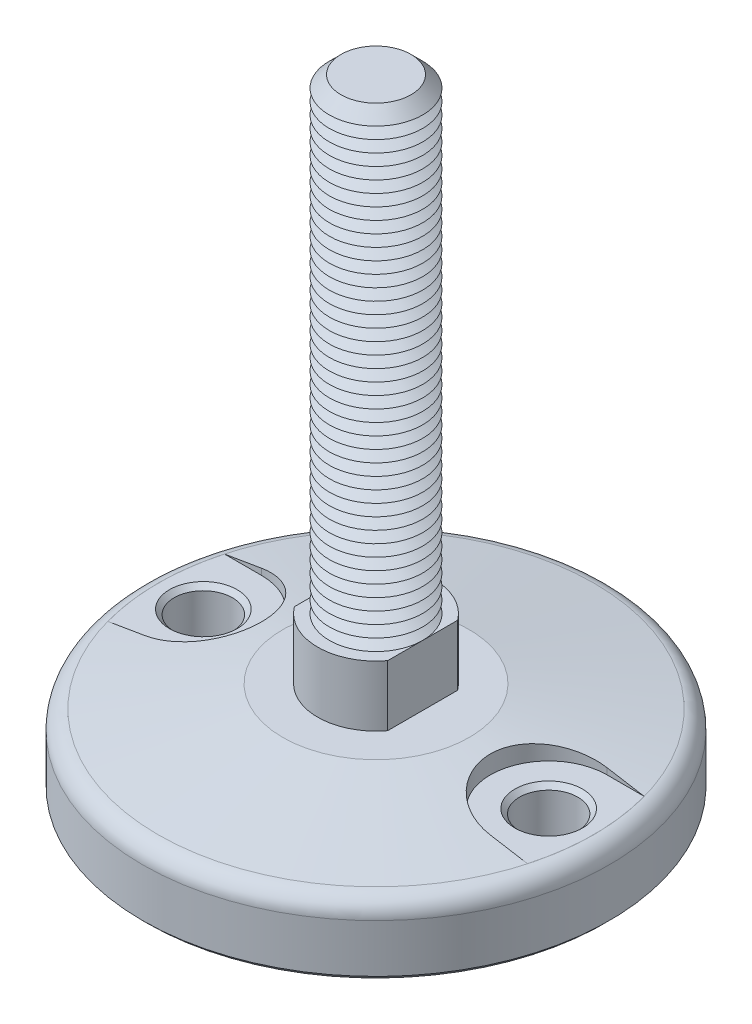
ISO-10303-21;
HEADER;
FILE_DESCRIPTION(('STEP AP214'),'2;1');
FILE_NAME('part.step','',(''),(''),'','','');
FILE_SCHEMA(('AUTOMOTIVE_DESIGN { 1 0 10303 214 1 1 1 1 }'));
ENDSEC;
DATA;
#1=APPLICATION_CONTEXT('core data for automotive mechanical design processes');
#2=APPLICATION_PROTOCOL_DEFINITION('international standard','automotive_design',2000,#1);
#3=PRODUCT_CONTEXT('',#1,'mechanical');
#4=PRODUCT('Part','Part','',(#3));
#5=PRODUCT_RELATED_PRODUCT_CATEGORY('part','',(#4));
#6=PRODUCT_DEFINITION_FORMATION('','',#4);
#7=PRODUCT_DEFINITION_CONTEXT('part definition',#1,'design');
#8=PRODUCT_DEFINITION('design','',#6,#7);
#9=PRODUCT_DEFINITION_SHAPE('','',#8);
#10=(LENGTH_UNIT() NAMED_UNIT(*) SI_UNIT(.MILLI.,.METRE.));
#11=(NAMED_UNIT(*) PLANE_ANGLE_UNIT() SI_UNIT($,.RADIAN.));
#12=(NAMED_UNIT(*) SI_UNIT($,.STERADIAN.) SOLID_ANGLE_UNIT());
#13=UNCERTAINTY_MEASURE_WITH_UNIT(LENGTH_MEASURE(1.E-05),#10,'distance_accuracy_value','');
#14=(GEOMETRIC_REPRESENTATION_CONTEXT(3) GLOBAL_UNCERTAINTY_ASSIGNED_CONTEXT((#13)) GLOBAL_UNIT_ASSIGNED_CONTEXT((#10,
#11,#12)) REPRESENTATION_CONTEXT('',''));
#15=CARTESIAN_POINT('',(0.,0.,0.));
#16=DIRECTION('',(0.,0.,1.));
#17=DIRECTION('',(1.,0.,0.));
#18=AXIS2_PLACEMENT_3D('',#15,#16,#17);
#19=CARTESIAN_POINT('',(0.,0.,0.));
#20=DIRECTION('',(0.,-1.,0.));
#21=DIRECTION('',(0.,0.,-1.));
#22=AXIS2_PLACEMENT_3D('',#19,#20,#21);
#23=CONICAL_SURFACE('',#22,20.,1.39626340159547);
#24=CARTESIAN_POINT('',(-37.0002,-3.35984690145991,12.4999999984));
#25=CARTESIAN_POINT('',(-36.6430801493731,-3.30019612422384,12.5000422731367));
#26=CARTESIAN_POINT('',(-36.286097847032,-3.23978096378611,12.4847089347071));
#27=CARTESIAN_POINT('',(-35.5749710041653,-3.11777545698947,12.423622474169));
#28=CARTESIAN_POINT('',(-35.2208262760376,-3.05618518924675,12.3778713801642));
#29=CARTESIAN_POINT('',(-34.5181114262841,-2.93221424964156,12.2563192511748));
#30=CARTESIAN_POINT('',(-34.1695379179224,-2.8698341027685,12.1805372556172));
#31=CARTESIAN_POINT('',(-33.4802130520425,-2.74463484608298,11.9995028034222));
#32=CARTESIAN_POINT('',(-33.1394616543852,-2.6818157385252,11.8942504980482));
#33=CARTESIAN_POINT('',(-32.4680688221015,-2.55613846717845,11.6549842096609));
#34=CARTESIAN_POINT('',(-32.1374312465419,-2.49328029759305,11.520959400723));
#35=CARTESIAN_POINT('',(-31.4887465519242,-2.36801465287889,11.2251130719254));
#36=CARTESIAN_POINT('',(-31.1706994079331,-2.30560717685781,11.063291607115));
#37=CARTESIAN_POINT('',(-30.54950311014,-2.18176290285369,10.7129930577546));
#38=CARTESIAN_POINT('',(-30.2463517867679,-2.12032596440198,10.524519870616));
#39=CARTESIAN_POINT('',(-29.6570687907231,-1.99897375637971,10.1221856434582));
#40=CARTESIAN_POINT('',(-29.3709370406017,-1.93905847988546,9.90832471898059));
#41=CARTESIAN_POINT('',(-28.8178459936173,-1.82137928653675,9.45673190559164));
#42=CARTESIAN_POINT('',(-28.5508809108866,-1.76361472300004,9.21900727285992));
#43=CARTESIAN_POINT('',(-28.0379874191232,-1.65088194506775,8.72124060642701));
#44=CARTESIAN_POINT('',(-27.7920590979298,-1.5959137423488,8.46119847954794));
#45=CARTESIAN_POINT('',(-27.323055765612,-1.48948182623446,7.9205326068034));
#46=CARTESIAN_POINT('',(-27.0999836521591,-1.43801855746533,7.63990625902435));
#47=CARTESIAN_POINT('',(-26.6784495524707,-1.33936166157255,7.06003375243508));
#48=CARTESIAN_POINT('',(-26.4799872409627,-1.29216797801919,6.76078783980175));
#49=CARTESIAN_POINT('',(-26.1117166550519,-1.20342811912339,6.14986205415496));
#50=CARTESIAN_POINT('',(-25.94156246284,-1.16181519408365,5.83840042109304));
#51=CARTESIAN_POINT('',(-25.628116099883,-1.08426427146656,5.20155792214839));
#52=CARTESIAN_POINT('',(-25.484823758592,-1.04832623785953,4.87617714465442));
#53=CARTESIAN_POINT('',(-25.2263277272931,-0.982857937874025,4.21390178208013));
#54=CARTESIAN_POINT('',(-25.1111175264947,-0.953326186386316,3.87700988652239));
#55=CARTESIAN_POINT('',(-24.9097439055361,-0.901314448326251,3.19412252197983));
#56=CARTESIAN_POINT('',(-24.8235797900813,-0.878834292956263,2.84812727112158));
#57=CARTESIAN_POINT('',(-24.6830159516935,-0.841972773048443,2.15919160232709));
#58=CARTESIAN_POINT('',(-24.6278129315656,-0.827386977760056,1.8164258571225));
#59=CARTESIAN_POINT('',(-24.5460973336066,-0.805742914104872,1.12725695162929));
#60=CARTESIAN_POINT('',(-24.5195842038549,-0.798684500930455,0.78085386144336));
#61=CARTESIAN_POINT('',(-24.4954839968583,-0.792269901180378,0.0870072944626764));
#62=CARTESIAN_POINT('',(-24.4978939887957,-0.79291293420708,-0.260436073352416));
#63=CARTESIAN_POINT('',(-24.5316115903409,-0.801883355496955,-0.953816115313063));
#64=CARTESIAN_POINT('',(-24.5629189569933,-0.810210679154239,-1.29975280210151));
#65=CARTESIAN_POINT('',(-24.6532283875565,-0.834099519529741,-1.98059726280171));
#66=CARTESIAN_POINT('',(-24.7116571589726,-0.849511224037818,-2.31558655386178));
#67=CARTESIAN_POINT('',(-24.8554972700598,-0.887161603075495,-2.97932206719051));
#68=CARTESIAN_POINT('',(-24.9409081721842,-0.909400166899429,-3.30806839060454));
#69=CARTESIAN_POINT('',(-25.1380243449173,-0.96022687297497,-3.95709027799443));
#70=CARTESIAN_POINT('',(-25.2497309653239,-0.988815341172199,-4.27736540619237));
#71=CARTESIAN_POINT('',(-25.498560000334,-1.05177019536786,-4.90729718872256));
#72=CARTESIAN_POINT('',(-25.6356828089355,-1.08613667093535,-5.21695367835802));
#73=CARTESIAN_POINT('',(-25.9361124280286,-1.16046648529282,-5.82730491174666));
#74=CARTESIAN_POINT('',(-26.0997157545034,-1.20049246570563,-6.12784605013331));
#75=CARTESIAN_POINT('',(-26.4506699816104,-1.28514282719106,-6.71404041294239));
#76=CARTESIAN_POINT('',(-26.6380209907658,-1.32976722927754,-6.99969356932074));
#77=CARTESIAN_POINT('',(-27.0351260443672,-1.42294054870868,-7.55431098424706));
#78=CARTESIAN_POINT('',(-27.2448809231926,-1.47148961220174,-7.82327462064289));
#79=CARTESIAN_POINT('',(-27.6853233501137,-1.57185653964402,-8.34282852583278));
#80=CARTESIAN_POINT('',(-27.9160114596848,-1.62367449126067,-8.59341830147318));
#81=CARTESIAN_POINT('',(-28.4034930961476,-1.73144835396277,-9.08142742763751));
#82=CARTESIAN_POINT('',(-28.660837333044,-1.78747956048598,-9.31828026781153));
#83=CARTESIAN_POINT('',(-29.1941741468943,-1.90170822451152,-9.7693949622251));
#84=CARTESIAN_POINT('',(-29.4701671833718,-1.95990573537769,-9.9836562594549));
#85=CARTESIAN_POINT('',(-30.0390002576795,-2.07790752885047,-10.3882796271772));
#86=CARTESIAN_POINT('',(-30.3318471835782,-2.1377124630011,-10.5786318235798));
#87=CARTESIAN_POINT('',(-30.9322646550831,-2.25836853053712,-10.9340888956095));
#88=CARTESIAN_POINT('',(-31.2398348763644,-2.31921964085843,-11.0991943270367));
#89=CARTESIAN_POINT('',(-31.8736774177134,-2.44266131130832,-11.4060146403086));
#90=CARTESIAN_POINT('',(-32.2001962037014,-2.50526276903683,-11.5472162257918));
#91=CARTESIAN_POINT('',(-32.8640586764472,-2.63057186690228,-11.8012839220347));
#92=CARTESIAN_POINT('',(-33.2014023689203,-2.69327950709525,-11.9141500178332));
#93=CARTESIAN_POINT('',(-33.8840988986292,-2.81828940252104,-12.1106227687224));
#94=CARTESIAN_POINT('',(-34.2294411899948,-2.88059206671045,-12.1942658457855));
#95=CARTESIAN_POINT('',(-34.9259788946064,-3.00445494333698,-12.3318436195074));
#96=CARTESIAN_POINT('',(-35.2771713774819,-3.06601550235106,-12.3857927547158));
#97=CARTESIAN_POINT('',(-35.8576122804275,-3.16637163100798,-12.4497947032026));
#98=CARTESIAN_POINT('',(-36.0858729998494,-3.20548751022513,-12.468632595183));
#99=CARTESIAN_POINT('',(-36.5427974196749,-3.2831194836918,-12.4937281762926));
#100=CARTESIAN_POINT('',(-36.7714598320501,-3.32163646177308,-12.5000065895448));
#101=CARTESIAN_POINT('',(-37.0002,-3.35984690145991,-12.4999999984));
#102=B_SPLINE_CURVE_WITH_KNOTS('',3,(#24,#25,#26,#27,#28,#29,#30,#31,#32,#33,#34,#35,#36,#37,
#38,#39,#40,#41,#42,#43,#44,#45,#46,#47,#48,#49,#50,#51,#52,#53,#54,#55,#56,#57,#58,#59,#60,#61,
#62,#63,#64,#65,#66,#67,#68,#69,#70,#71,#72,#73,#74,#75,#76,#77,#78,#79,#80,#81,#82,#83,#84,#85,
#86,#87,#88,#89,#90,#91,#92,#93,#94,#95,#96,#97,#98,#99,#100,#101),.UNSPECIFIED.,.F.,.F.,(4,2,2,
2,2,2,2,2,2,2,2,2,2,2,2,2,2,2,2,2,2,2,2,2,2,2,2,2,2,2,2,2,2,2,2,2,2,2,4),(0.,1.08586245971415,
2.171652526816,3.25675530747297,4.34185251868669,5.42735872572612,6.51286278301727,
7.59820826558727,8.68354880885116,9.76856032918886,10.853576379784,11.9387298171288,
13.0238689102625,14.0945791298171,15.1652825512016,16.2357374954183,17.3061668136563,
18.3473597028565,19.3885325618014,20.4295999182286,21.4706585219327,22.4906487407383,
23.5106224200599,24.5306484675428,25.5506903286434,26.5830642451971,27.6154428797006,
28.6478599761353,29.680304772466,30.7417064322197,31.8031342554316,32.8649990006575,
33.9268403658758,35.0091880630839,36.0915363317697,37.1725307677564,38.2529991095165,
38.9497417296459,39.6453337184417),.UNSPECIFIED.);
#103=CARTESIAN_POINT('',(-37.,-3.35981349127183,12.5));
#104=VERTEX_POINT('',#103);
#105=CARTESIAN_POINT('',(-37.,-3.35981349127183,-12.5));
#106=VERTEX_POINT('',#105);
#107=EDGE_CURVE('E580',#104,#106,#102,.T.);
#108=ORIENTED_EDGE('',*,*,#107,.F.);
#109=CARTESIAN_POINT('',(-61.7266967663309,-7.57847020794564,12.5));
#110=CARTESIAN_POINT('',(-60.2351929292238,-7.320720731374,12.5));
#111=CARTESIAN_POINT('',(-58.7436306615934,-7.06330856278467,12.5));
#112=CARTESIAN_POINT('',(-55.7603527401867,-6.54937673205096,12.5));
#113=CARTESIAN_POINT('',(-54.2686370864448,-6.29285706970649,12.5));
#114=CARTESIAN_POINT('',(-51.2850284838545,-5.78093030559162,12.5));
#115=CARTESIAN_POINT('',(-49.7931355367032,-5.52552319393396,12.5));
#116=CARTESIAN_POINT('',(-46.8091047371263,-5.01613816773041,12.5));
#117=CARTESIAN_POINT('',(-45.3169668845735,-4.76216025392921,12.5));
#118=CARTESIAN_POINT('',(-42.3323589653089,-4.25607669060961,12.5));
#119=CARTESIAN_POINT('',(-40.8398888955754,-4.00397105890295,12.5));
#120=CARTESIAN_POINT('',(-37.8545274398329,-3.50227519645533,12.5));
#121=CARTESIAN_POINT('',(-36.3616360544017,-3.252684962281,12.5));
#122=CARTESIAN_POINT('',(-34.1218562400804,-2.88092207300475,12.5));
#123=CARTESIAN_POINT('',(-33.3751855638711,-2.7574375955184,12.5));
#124=CARTESIAN_POINT('',(-31.8816714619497,-2.51151914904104,12.5));
#125=CARTESIAN_POINT('',(-31.1348280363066,-2.38908517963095,12.5));
#126=CARTESIAN_POINT('',(-29.6409325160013,-2.14547417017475,12.5));
#127=CARTESIAN_POINT('',(-28.8938804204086,-2.024297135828,12.5));
#128=CARTESIAN_POINT('',(-27.3995261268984,-1.78348915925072,12.5));
#129=CARTESIAN_POINT('',(-26.6522239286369,-1.66385821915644,12.5));
#130=CARTESIAN_POINT('',(-25.9047753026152,-1.54514479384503,12.5));
#131=B_SPLINE_CURVE_WITH_KNOTS('',3,(#109,#110,#111,#112,#113,#114,#115,#116,#117,#118,#119,
#120,#121,#122,#123,#124,#125,#126,#127,#128,#129,#130),.UNSPECIFIED.,.F.,.F.,(4,2,2,2,2,2,2,2,
2,2,4),(0.,4.54083339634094,9.08166577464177,13.6224577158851,18.1632520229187,22.7040894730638,
27.2449207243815,29.5153583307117,31.7857950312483,34.0562420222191,36.3266921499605),.UNSPECIFIED.);
#132=CARTESIAN_POINT('',(-44.9493194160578,-4.7,12.5));
#133=VERTEX_POINT('',#132);
#134=EDGE_CURVE('E554',#133,#104,#131,.T.);
#135=ORIENTED_EDGE('',*,*,#134,.F.);
#136=CARTESIAN_POINT('',(0.,-4.7,0.));
#137=DIRECTION('',(0.,1.,0.));
#138=DIRECTION('',(0.,0.,1.));
#139=AXIS2_PLACEMENT_3D('',#136,#137,#138);
#140=CIRCLE('',#139,46.6550245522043);
#141=CARTESIAN_POINT('',(-44.9493194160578,-4.7,-12.5));
#142=VERTEX_POINT('',#141);
#143=EDGE_CURVE('E543',#133,#142,#140,.F.);
#144=ORIENTED_EDGE('',*,*,#143,.T.);
#145=CARTESIAN_POINT('',(-25.9047753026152,-1.54514479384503,-12.5));
#146=CARTESIAN_POINT('',(-26.6522239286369,-1.66385821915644,-12.5));
#147=CARTESIAN_POINT('',(-27.3995261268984,-1.78348915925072,-12.5));
#148=CARTESIAN_POINT('',(-28.8938804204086,-2.024297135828,-12.5));
#149=CARTESIAN_POINT('',(-29.6409325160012,-2.14547417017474,-12.5));
#150=CARTESIAN_POINT('',(-31.1348280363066,-2.38908517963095,-12.5));
#151=CARTESIAN_POINT('',(-31.8816714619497,-2.51151914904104,-12.5));
#152=CARTESIAN_POINT('',(-33.3751855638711,-2.7574375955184,-12.5));
#153=CARTESIAN_POINT('',(-34.1218562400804,-2.88092207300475,-12.5));
#154=CARTESIAN_POINT('',(-36.3616360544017,-3.252684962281,-12.5));
#155=CARTESIAN_POINT('',(-37.8545274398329,-3.50227519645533,-12.5));
#156=CARTESIAN_POINT('',(-40.8398888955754,-4.00397105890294,-12.5));
#157=CARTESIAN_POINT('',(-42.3323589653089,-4.2560766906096,-12.5));
#158=CARTESIAN_POINT('',(-45.3169668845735,-4.7621602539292,-12.5));
#159=CARTESIAN_POINT('',(-46.8091047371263,-5.01613816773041,-12.5));
#160=CARTESIAN_POINT('',(-49.7931355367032,-5.52552319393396,-12.5));
#161=CARTESIAN_POINT('',(-51.2850284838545,-5.78093030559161,-12.5));
#162=CARTESIAN_POINT('',(-54.2686370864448,-6.29285706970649,-12.5));
#163=CARTESIAN_POINT('',(-55.7603527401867,-6.54937673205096,-12.5));
#164=CARTESIAN_POINT('',(-58.7436306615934,-7.06330856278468,-12.5));
#165=CARTESIAN_POINT('',(-60.2351929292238,-7.320720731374,-12.5));
#166=CARTESIAN_POINT('',(-61.7266967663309,-7.57847020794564,-12.5));
#167=B_SPLINE_CURVE_WITH_KNOTS('',3,(#145,#146,#147,#148,#149,#150,#151,#152,#153,#154,#155,
#156,#157,#158,#159,#160,#161,#162,#163,#164,#165,#166),.UNSPECIFIED.,.F.,.F.,(4,2,2,2,2,2,2,2,
2,2,4),(0.,2.27045012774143,4.54089711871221,6.81133381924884,9.08177142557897,13.6226026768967,
18.1634401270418,22.7042344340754,27.2450263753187,31.7858587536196,36.3266921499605),.UNSPECIFIED.);
#168=EDGE_CURVE('E547',#106,#142,#167,.T.);
#169=ORIENTED_EDGE('',*,*,#168,.F.);
#170=EDGE_LOOP('',(#108,#135,#144,#169));
#171=FACE_BOUND('',#170,.T.);
#172=CARTESIAN_POINT('',(0.,-4.70697693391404,0.));
#173=DIRECTION('',(0.,1.,0.));
#174=DIRECTION('',(0.,0.,1.));
#175=AXIS2_PLACEMENT_3D('',#172,#173,#174);
#176=CIRCLE('',#175,46.6945927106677);
#177=CARTESIAN_POINT('',(0.,-4.70697693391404,46.6945927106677));
#178=VERTEX_POINT('',#177);
#179=EDGE_CURVE('E532',#178,#178,#176,.T.);
#180=ORIENTED_EDGE('',*,*,#179,.T.);
#181=EDGE_LOOP('',(#180));
#182=FACE_BOUND('',#181,.T.);
#183=CARTESIAN_POINT('',(0.,0.,0.));
#184=DIRECTION('',(0.,1.,0.));
#185=DIRECTION('',(0.,0.,1.));
#186=AXIS2_PLACEMENT_3D('',#183,#184,#185);
#187=CIRCLE('',#186,20.);
#188=CARTESIAN_POINT('',(0.,0.,20.));
#189=VERTEX_POINT('',#188);
#190=EDGE_CURVE('E528',#189,#189,#187,.T.);
#191=ORIENTED_EDGE('',*,*,#190,.F.);
#192=EDGE_LOOP('',(#191));
#193=FACE_BOUND('',#192,.T.);
#194=CARTESIAN_POINT('',(55.9042883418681,-6.57430258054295,12.5));
#195=CARTESIAN_POINT('',(54.412585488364,-6.31763127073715,12.5));
#196=CARTESIAN_POINT('',(52.9208062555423,-6.06140219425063,12.5));
#197=CARTESIAN_POINT('',(49.9370413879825,-5.55015786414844,12.5));
#198=CARTESIAN_POINT('',(48.4450557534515,-5.29514260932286,12.5));
#199=CARTESIAN_POINT('',(45.4608530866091,-4.78666015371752,12.5));
#200=CARTESIAN_POINT('',(43.9686360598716,-4.53319292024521,12.5));
#201=CARTESIAN_POINT('',(40.9838536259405,-4.02830138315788,12.5));
#202=CARTESIAN_POINT('',(39.4912882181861,-3.7768770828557,12.5));
#203=CARTESIAN_POINT('',(36.50565536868,-3.27679220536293,12.5));
#204=CARTESIAN_POINT('',(35.0125879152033,-3.02813169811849,12.5));
#205=CARTESIAN_POINT('',(32.0258195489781,-2.53467103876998,12.5));
#206=CARTESIAN_POINT('',(30.5321186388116,-2.28987087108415,12.5));
#207=CARTESIAN_POINT('',(28.290865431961,-1.92688841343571,12.5));
#208=CARTESIAN_POINT('',(27.5436550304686,-1.80659579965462,12.5));
#209=CARTESIAN_POINT('',(26.0489572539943,-1.56774876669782,12.5));
#210=CARTESIAN_POINT('',(25.3014698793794,-1.44919434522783,12.5));
#211=CARTESIAN_POINT('',(23.8061486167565,-1.21422016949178,12.5));
#212=CARTESIAN_POINT('',(23.0583147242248,-1.09780044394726,12.5));
#213=CARTESIAN_POINT('',(21.5622260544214,-0.867676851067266,12.5));
#214=CARTESIAN_POINT('',(20.8139712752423,-0.753972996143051,12.5));
#215=CARTESIAN_POINT('',(20.0654672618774,-0.641917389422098,12.5));
#216=B_SPLINE_CURVE_WITH_KNOTS('',3,(#194,#195,#196,#197,#198,#199,#200,#201,#202,#203,#204,
#205,#206,#207,#208,#209,#210,#211,#212,#213,#214,#215),.UNSPECIFIED.,.F.,.F.,(4,2,2,2,2,2,2,2,
2,2,4),(0.,4.54087231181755,9.08174009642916,13.6225116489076,18.1632905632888,22.7041841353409,
27.2450593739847,29.515551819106,31.7860412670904,34.0565612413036,36.3270915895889),.UNSPECIFIED.);
#217=CARTESIAN_POINT('',(44.9493194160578,-4.7,12.5));
#218=VERTEX_POINT('',#217);
#219=CARTESIAN_POINT('',(37.,-3.35981349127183,12.5));
#220=VERTEX_POINT('',#219);
#221=EDGE_CURVE('E127',#218,#220,#216,.T.);
#222=ORIENTED_EDGE('',*,*,#221,.T.);
#223=CARTESIAN_POINT('',(37.0002,-3.35984690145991,12.4999999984));
#224=CARTESIAN_POINT('',(36.6430801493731,-3.30019612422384,12.5000422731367));
#225=CARTESIAN_POINT('',(36.286097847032,-3.23978096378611,12.4847089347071));
#226=CARTESIAN_POINT('',(35.5749710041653,-3.11777545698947,12.423622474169));
#227=CARTESIAN_POINT('',(35.2208262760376,-3.05618518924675,12.3778713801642));
#228=CARTESIAN_POINT('',(34.5181114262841,-2.93221424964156,12.2563192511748));
#229=CARTESIAN_POINT('',(34.1695379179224,-2.8698341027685,12.1805372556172));
#230=CARTESIAN_POINT('',(33.4802130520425,-2.74463484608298,11.9995028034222));
#231=CARTESIAN_POINT('',(33.1394616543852,-2.6818157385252,11.8942504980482));
#232=CARTESIAN_POINT('',(32.4680688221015,-2.55613846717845,11.6549842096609));
#233=CARTESIAN_POINT('',(32.1374312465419,-2.49328029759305,11.520959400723));
#234=CARTESIAN_POINT('',(31.4887465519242,-2.36801465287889,11.2251130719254));
#235=CARTESIAN_POINT('',(31.1706994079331,-2.30560717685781,11.063291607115));
#236=CARTESIAN_POINT('',(30.54950311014,-2.18176290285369,10.7129930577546));
#237=CARTESIAN_POINT('',(30.2463517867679,-2.12032596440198,10.524519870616));
#238=CARTESIAN_POINT('',(29.6570687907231,-1.99897375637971,10.1221856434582));
#239=CARTESIAN_POINT('',(29.3709370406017,-1.93905847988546,9.90832471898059));
#240=CARTESIAN_POINT('',(28.8178459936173,-1.82137928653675,9.45673190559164));
#241=CARTESIAN_POINT('',(28.5508809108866,-1.76361472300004,9.21900727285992));
#242=CARTESIAN_POINT('',(28.0379874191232,-1.65088194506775,8.72124060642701));
#243=CARTESIAN_POINT('',(27.7920590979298,-1.5959137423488,8.46119847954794));
#244=CARTESIAN_POINT('',(27.323055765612,-1.48948182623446,7.9205326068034));
#245=CARTESIAN_POINT('',(27.0999836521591,-1.43801855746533,7.63990625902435));
#246=CARTESIAN_POINT('',(26.6784495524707,-1.33936166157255,7.06003375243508));
#247=CARTESIAN_POINT('',(26.4799872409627,-1.29216797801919,6.76078783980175));
#248=CARTESIAN_POINT('',(26.1117166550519,-1.20342811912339,6.14986205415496));
#249=CARTESIAN_POINT('',(25.94156246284,-1.16181519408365,5.83840042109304));
#250=CARTESIAN_POINT('',(25.628116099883,-1.08426427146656,5.20155792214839));
#251=CARTESIAN_POINT('',(25.484823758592,-1.04832623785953,4.87617714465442));
#252=CARTESIAN_POINT('',(25.2263277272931,-0.982857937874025,4.21390178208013));
#253=CARTESIAN_POINT('',(25.1111175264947,-0.953326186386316,3.87700988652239));
#254=CARTESIAN_POINT('',(24.9097439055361,-0.901314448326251,3.19412252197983));
#255=CARTESIAN_POINT('',(24.8235797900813,-0.878834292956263,2.84812727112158));
#256=CARTESIAN_POINT('',(24.6830159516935,-0.841972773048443,2.15919160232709));
#257=CARTESIAN_POINT('',(24.6278129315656,-0.827386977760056,1.8164258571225));
#258=CARTESIAN_POINT('',(24.5460973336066,-0.805742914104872,1.12725695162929));
#259=CARTESIAN_POINT('',(24.5195842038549,-0.798684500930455,0.78085386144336));
#260=CARTESIAN_POINT('',(24.4954839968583,-0.792269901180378,0.0870072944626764));
#261=CARTESIAN_POINT('',(24.4978939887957,-0.79291293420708,-0.260436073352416));
#262=CARTESIAN_POINT('',(24.5316115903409,-0.801883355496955,-0.953816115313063));
#263=CARTESIAN_POINT('',(24.5629189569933,-0.810210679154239,-1.29975280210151));
#264=CARTESIAN_POINT('',(24.6532283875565,-0.834099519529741,-1.98059726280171));
#265=CARTESIAN_POINT('',(24.7116571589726,-0.849511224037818,-2.31558655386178));
#266=CARTESIAN_POINT('',(24.8554972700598,-0.887161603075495,-2.97932206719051));
#267=CARTESIAN_POINT('',(24.9409081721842,-0.909400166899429,-3.30806839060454));
#268=CARTESIAN_POINT('',(25.1380243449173,-0.96022687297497,-3.95709027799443));
#269=CARTESIAN_POINT('',(25.2497309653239,-0.988815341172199,-4.27736540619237));
#270=CARTESIAN_POINT('',(25.498560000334,-1.05177019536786,-4.90729718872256));
#271=CARTESIAN_POINT('',(25.6356828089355,-1.08613667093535,-5.21695367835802));
#272=CARTESIAN_POINT('',(25.9361124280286,-1.16046648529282,-5.82730491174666));
#273=CARTESIAN_POINT('',(26.0997157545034,-1.20049246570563,-6.12784605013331));
#274=CARTESIAN_POINT('',(26.4506699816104,-1.28514282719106,-6.71404041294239));
#275=CARTESIAN_POINT('',(26.6380209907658,-1.32976722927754,-6.99969356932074));
#276=CARTESIAN_POINT('',(27.0351260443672,-1.42294054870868,-7.55431098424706));
#277=CARTESIAN_POINT('',(27.2448809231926,-1.47148961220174,-7.82327462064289));
#278=CARTESIAN_POINT('',(27.6853233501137,-1.57185653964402,-8.34282852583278));
#279=CARTESIAN_POINT('',(27.9160114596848,-1.62367449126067,-8.59341830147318));
#280=CARTESIAN_POINT('',(28.4034930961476,-1.73144835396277,-9.08142742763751));
#281=CARTESIAN_POINT('',(28.660837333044,-1.78747956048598,-9.31828026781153));
#282=CARTESIAN_POINT('',(29.1941741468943,-1.90170822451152,-9.7693949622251));
#283=CARTESIAN_POINT('',(29.4701671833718,-1.95990573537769,-9.9836562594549));
#284=CARTESIAN_POINT('',(30.0390002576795,-2.07790752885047,-10.3882796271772));
#285=CARTESIAN_POINT('',(30.3318471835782,-2.1377124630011,-10.5786318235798));
#286=CARTESIAN_POINT('',(30.9322646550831,-2.25836853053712,-10.9340888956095));
#287=CARTESIAN_POINT('',(31.2398348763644,-2.31921964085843,-11.0991943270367));
#288=CARTESIAN_POINT('',(31.8736774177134,-2.44266131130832,-11.4060146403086));
#289=CARTESIAN_POINT('',(32.2001962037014,-2.50526276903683,-11.5472162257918));
#290=CARTESIAN_POINT('',(32.8640586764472,-2.63057186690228,-11.8012839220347));
#291=CARTESIAN_POINT('',(33.2014023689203,-2.69327950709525,-11.9141500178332));
#292=CARTESIAN_POINT('',(33.8840988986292,-2.81828940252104,-12.1106227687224));
#293=CARTESIAN_POINT('',(34.2294411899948,-2.88059206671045,-12.1942658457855));
#294=CARTESIAN_POINT('',(34.9259788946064,-3.00445494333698,-12.3318436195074));
#295=CARTESIAN_POINT('',(35.2771713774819,-3.06601550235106,-12.3857927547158));
#296=CARTESIAN_POINT('',(35.8576122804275,-3.16637163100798,-12.4497947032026));
#297=CARTESIAN_POINT('',(36.0858729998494,-3.20548751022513,-12.468632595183));
#298=CARTESIAN_POINT('',(36.5427974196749,-3.2831194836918,-12.4937281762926));
#299=CARTESIAN_POINT('',(36.7714598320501,-3.32163646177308,-12.5000065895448));
#300=CARTESIAN_POINT('',(37.0002,-3.35984690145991,-12.4999999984));
#301=B_SPLINE_CURVE_WITH_KNOTS('',3,(#223,#224,#225,#226,#227,#228,#229,#230,#231,#232,#233,
#234,#235,#236,#237,#238,#239,#240,#241,#242,#243,#244,#245,#246,#247,#248,#249,#250,#251,#252,
#253,#254,#255,#256,#257,#258,#259,#260,#261,#262,#263,#264,#265,#266,#267,#268,#269,#270,#271,
#272,#273,#274,#275,#276,#277,#278,#279,#280,#281,#282,#283,#284,#285,#286,#287,#288,#289,#290,
#291,#292,#293,#294,#295,#296,#297,#298,#299,#300),.UNSPECIFIED.,.F.,.F.,(4,2,2,2,2,2,2,2,2,2,2,
2,2,2,2,2,2,2,2,2,2,2,2,2,2,2,2,2,2,2,2,2,2,2,2,2,2,2,4),(0.,1.08586245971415,2.171652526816,
3.25675530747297,4.34185251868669,5.42735872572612,6.51286278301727,7.59820826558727,
8.68354880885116,9.76856032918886,10.853576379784,11.9387298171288,13.0238689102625,
14.0945791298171,15.1652825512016,16.2357374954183,17.3061668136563,18.3473597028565,
19.3885325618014,20.4295999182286,21.4706585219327,22.4906487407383,23.5106224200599,
24.5306484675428,25.5506903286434,26.5830642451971,27.6154428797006,28.6478599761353,
29.680304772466,30.7417064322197,31.8031342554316,32.8649990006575,33.9268403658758,
35.0091880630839,36.0915363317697,37.1725307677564,38.2529991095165,38.9497417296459,
39.6453337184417),.UNSPECIFIED.);
#302=CARTESIAN_POINT('',(37.,-3.35981349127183,-12.5));
#303=VERTEX_POINT('',#302);
#304=EDGE_CURVE('E139',#220,#303,#301,.T.);
#305=ORIENTED_EDGE('',*,*,#304,.T.);
#306=CARTESIAN_POINT('',(20.0654672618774,-0.641917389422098,-12.5));
#307=CARTESIAN_POINT('',(20.8139712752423,-0.753972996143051,-12.5));
#308=CARTESIAN_POINT('',(21.5622260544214,-0.867676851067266,-12.5));
#309=CARTESIAN_POINT('',(23.0583147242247,-1.09780044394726,-12.5));
#310=CARTESIAN_POINT('',(23.8061486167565,-1.21422016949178,-12.5));
#311=CARTESIAN_POINT('',(25.3014698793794,-1.44919434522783,-12.5));
#312=CARTESIAN_POINT('',(26.0489572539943,-1.56774876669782,-12.5));
#313=CARTESIAN_POINT('',(27.5436550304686,-1.80659579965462,-12.5));
#314=CARTESIAN_POINT('',(28.290865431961,-1.92688841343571,-12.5));
#315=CARTESIAN_POINT('',(30.5321186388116,-2.28987087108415,-12.5));
#316=CARTESIAN_POINT('',(32.0258195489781,-2.53467103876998,-12.5));
#317=CARTESIAN_POINT('',(35.0125879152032,-3.02813169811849,-12.5));
#318=CARTESIAN_POINT('',(36.50565536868,-3.27679220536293,-12.5));
#319=CARTESIAN_POINT('',(39.4912882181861,-3.7768770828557,-12.5));
#320=CARTESIAN_POINT('',(40.9838536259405,-4.02830138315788,-12.5));
#321=CARTESIAN_POINT('',(43.9686360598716,-4.53319292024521,-12.5));
#322=CARTESIAN_POINT('',(45.4608530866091,-4.78666015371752,-12.5));
#323=CARTESIAN_POINT('',(48.4450557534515,-5.29514260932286,-12.5));
#324=CARTESIAN_POINT('',(49.9370413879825,-5.55015786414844,-12.5));
#325=CARTESIAN_POINT('',(52.9208062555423,-6.06140219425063,-12.5));
#326=CARTESIAN_POINT('',(54.412585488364,-6.31763127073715,-12.5));
#327=CARTESIAN_POINT('',(55.9042883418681,-6.57430258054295,-12.5));
#328=B_SPLINE_CURVE_WITH_KNOTS('',3,(#306,#307,#308,#309,#310,#311,#312,#313,#314,#315,#316,
#317,#318,#319,#320,#321,#322,#323,#324,#325,#326,#327),.UNSPECIFIED.,.F.,.F.,(4,2,2,2,2,2,2,2,
2,2,4),(0.,2.27053034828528,4.54105032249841,6.81153977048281,9.08203221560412,13.6229074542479,
18.1638010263,22.7045799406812,27.2453514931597,31.7862192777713,36.3270915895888),.UNSPECIFIED.);
#329=CARTESIAN_POINT('',(44.9493194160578,-4.7,-12.5));
#330=VERTEX_POINT('',#329);
#331=EDGE_CURVE('E611',#303,#330,#328,.T.);
#332=ORIENTED_EDGE('',*,*,#331,.T.);
#333=CARTESIAN_POINT('',(0.,-4.7,0.));
#334=DIRECTION('',(0.,1.,0.));
#335=DIRECTION('',(0.,0.,1.));
#336=AXIS2_PLACEMENT_3D('',#333,#334,#335);
#337=CIRCLE('',#336,46.6550245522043);
#338=EDGE_CURVE('E602',#330,#218,#337,.F.);
#339=ORIENTED_EDGE('',*,*,#338,.T.);
#340=EDGE_LOOP('',(#222,#305,#332,#339));
#341=FACE_BOUND('',#340,.T.);
#342=ADVANCED_FACE('F39',(#171,#182,#193,#341),#23,.T.);
#343=CARTESIAN_POINT('',(0.,13.,0.));
#344=DIRECTION('',(0.,1.,0.));
#345=DIRECTION('',(0.,0.,1.));
#346=AXIS2_PLACEMENT_3D('',#343,#344,#345);
#347=PLANE('',#346);
#348=CARTESIAN_POINT('',(0.,13.,0.));
#349=DIRECTION('',(0.,1.,0.));
#350=DIRECTION('',(0.,0.,1.));
#351=AXIS2_PLACEMENT_3D('',#348,#349,#350);
#352=CIRCLE('',#351,10.);
#353=CARTESIAN_POINT('',(10.,13.,0.));
#354=VERTEX_POINT('',#353);
#355=CARTESIAN_POINT('',(-10.,13.,0.));
#356=VERTEX_POINT('',#355);
#357=EDGE_CURVE('E481',#354,#356,#352,.T.);
#358=ORIENTED_EDGE('',*,*,#357,.F.);
#359=DIRECTION('',(0.,0.,1.));
#360=VECTOR('',#359,1.);
#361=CARTESIAN_POINT('',(10.,13.,7.5));
#362=LINE('',#361,#360);
#363=CARTESIAN_POINT('',(10.,13.,-7.5));
#364=VERTEX_POINT('',#363);
#365=EDGE_CURVE('E508',#364,#354,#362,.T.);
#366=ORIENTED_EDGE('',*,*,#365,.F.);
#367=CARTESIAN_POINT('',(0.,13.,0.));
#368=DIRECTION('',(0.,1.,0.));
#369=DIRECTION('',(0.,0.,1.));
#370=AXIS2_PLACEMENT_3D('',#367,#368,#369);
#371=CIRCLE('',#370,12.5);
#372=CARTESIAN_POINT('',(-10.,13.,-7.5));
#373=VERTEX_POINT('',#372);
#374=EDGE_CURVE('E521',#364,#373,#371,.T.);
#375=ORIENTED_EDGE('',*,*,#374,.T.);
#376=DIRECTION('',(0.,0.,-1.));
#377=VECTOR('',#376,1.);
#378=CARTESIAN_POINT('',(-10.,13.,-7.5));
#379=LINE('',#378,#377);
#380=EDGE_CURVE('E495',#356,#373,#379,.T.);
#381=ORIENTED_EDGE('',*,*,#380,.F.);
#382=EDGE_LOOP('',(#358,#366,#375,#381));
#383=FACE_BOUND('',#382,.T.);
#384=ADVANCED_FACE('F665',(#383),#347,.T.);
#385=CARTESIAN_POINT('',(0.,13.,0.));
#386=DIRECTION('',(0.,-1.,0.));
#387=DIRECTION('',(0.,0.,-1.));
#388=AXIS2_PLACEMENT_3D('',#385,#386,#387);
#389=CYLINDRICAL_SURFACE('',#388,12.5);
#390=CARTESIAN_POINT('',(-10.,13.,7.5));
#391=VERTEX_POINT('',#390);
#392=CARTESIAN_POINT('',(10.,13.,7.5));
#393=VERTEX_POINT('',#392);
#394=EDGE_CURVE('E500',#391,#393,#371,.T.);
#395=ORIENTED_EDGE('',*,*,#394,.F.);
#396=DIRECTION('',(0.,1.,0.));
#397=VECTOR('',#396,1.);
#398=CARTESIAN_POINT('',(-10.,0.,7.5));
#399=LINE('',#398,#397);
#400=CARTESIAN_POINT('',(-10.,0.,7.5));
#401=VERTEX_POINT('',#400);
#402=EDGE_CURVE('E490',#401,#391,#399,.T.);
#403=ORIENTED_EDGE('',*,*,#402,.F.);
#404=CARTESIAN_POINT('',(0.,0.,0.));
#405=DIRECTION('',(0.,1.,0.));
#406=DIRECTION('',(0.,0.,1.));
#407=AXIS2_PLACEMENT_3D('',#404,#405,#406);
#408=CIRCLE('',#407,12.5);
#409=CARTESIAN_POINT('',(10.,0.,7.5));
#410=VERTEX_POINT('',#409);
#411=EDGE_CURVE('E522',#401,#410,#408,.T.);
#412=ORIENTED_EDGE('',*,*,#411,.T.);
#413=DIRECTION('',(0.,1.,0.));
#414=VECTOR('',#413,1.);
#415=CARTESIAN_POINT('',(10.,0.,7.5));
#416=LINE('',#415,#414);
#417=EDGE_CURVE('E512',#410,#393,#416,.T.);
#418=ORIENTED_EDGE('',*,*,#417,.T.);
#419=EDGE_LOOP('',(#395,#403,#412,#418));
#420=FACE_BOUND('',#419,.T.);
#421=ADVANCED_FACE('F670',(#420),#389,.T.);
#422=CARTESIAN_POINT('',(0.,0.,0.));
#423=DIRECTION('',(0.,1.,0.));
#424=DIRECTION('',(0.,0.,1.));
#425=AXIS2_PLACEMENT_3D('',#422,#423,#424);
#426=PLANE('',#425);
#427=CARTESIAN_POINT('',(10.,0.,-7.5));
#428=VERTEX_POINT('',#427);
#429=CARTESIAN_POINT('',(-10.,0.,-7.5));
#430=VERTEX_POINT('',#429);
#431=EDGE_CURVE('E526',#428,#430,#408,.T.);
#432=ORIENTED_EDGE('',*,*,#431,.F.);
#433=DIRECTION('',(0.,0.,1.));
#434=VECTOR('',#433,1.);
#435=CARTESIAN_POINT('',(10.,0.,7.5));
#436=LINE('',#435,#434);
#437=EDGE_CURVE('E503',#428,#410,#436,.T.);
#438=ORIENTED_EDGE('',*,*,#437,.T.);
#439=ORIENTED_EDGE('',*,*,#411,.F.);
#440=DIRECTION('',(0.,0.,-1.));
#441=VECTOR('',#440,1.);
#442=CARTESIAN_POINT('',(-10.,0.,-7.5));
#443=LINE('',#442,#441);
#444=EDGE_CURVE('E486',#401,#430,#443,.T.);
#445=ORIENTED_EDGE('',*,*,#444,.T.);
#446=EDGE_LOOP('',(#432,#438,#439,#445));
#447=FACE_BOUND('',#446,.T.);
#448=ORIENTED_EDGE('',*,*,#190,.T.);
#449=EDGE_LOOP('',(#448));
#450=FACE_BOUND('',#449,.T.);
#451=ADVANCED_FACE('F770',(#447,#450),#426,.T.);
#452=CARTESIAN_POINT('',(0.,61.3388655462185,0.));
#453=DIRECTION('',(0.,1.,0.));
#454=DIRECTION('',(0.,0.,1.));
#455=AXIS2_PLACEMENT_3D('',#452,#453,#454);
#456=CYLINDRICAL_SURFACE('',#455,50.);
#457=CARTESIAN_POINT('',(0.,-19.,0.));
#458=DIRECTION('',(0.,-1.,0.));
#459=DIRECTION('',(0.,0.,-1.));
#460=AXIS2_PLACEMENT_3D('',#457,#458,#459);
#461=CIRCLE('',#460,50.);
#462=CARTESIAN_POINT('',(0.,-19.,-50.));
#463=VERTEX_POINT('',#462);
#464=EDGE_CURVE('E48',#463,#463,#461,.F.);
#465=ORIENTED_EDGE('',*,*,#464,.T.);
#466=EDGE_LOOP('',(#465));
#467=FACE_BOUND('',#466,.T.);
#468=CARTESIAN_POINT('',(0.,-8.64620794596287,0.));
#469=DIRECTION('',(0.,-1.,0.));
#470=DIRECTION('',(0.,0.,-1.));
#471=AXIS2_PLACEMENT_3D('',#468,#469,#470);
#472=CIRCLE('',#471,50.);
#473=CARTESIAN_POINT('',(0.,-8.64620794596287,-50.));
#474=VERTEX_POINT('',#473);
#475=EDGE_CURVE('E527',#474,#474,#472,.T.);
#476=ORIENTED_EDGE('',*,*,#475,.T.);
#477=EDGE_LOOP('',(#476));
#478=FACE_BOUND('',#477,.T.);
#479=ADVANCED_FACE('F652',(#467,#478),#456,.T.);
#480=CARTESIAN_POINT('',(0.,-20.,50.));
#481=DIRECTION('',(0.,-1.,0.));
#482=DIRECTION('',(0.,0.,-1.));
#483=AXIS2_PLACEMENT_3D('',#480,#481,#482);
#484=PLANE('',#483);
#485=CARTESIAN_POINT('',(0.,-20.,0.));
#486=DIRECTION('',(0.,-1.,0.));
#487=DIRECTION('',(0.,0.,-1.));
#488=AXIS2_PLACEMENT_3D('',#485,#486,#487);
#489=CIRCLE('',#488,49.);
#490=CARTESIAN_POINT('',(0.,-20.,-49.));
#491=VERTEX_POINT('',#490);
#492=EDGE_CURVE('E11',#491,#491,#489,.T.);
#493=ORIENTED_EDGE('',*,*,#492,.T.);
#494=EDGE_LOOP('',(#493));
#495=FACE_BOUND('',#494,.T.);
#496=CARTESIAN_POINT('',(37.,-20.,0.));
#497=DIRECTION('',(0.,-1.,0.));
#498=DIRECTION('',(0.,0.,-1.));
#499=AXIS2_PLACEMENT_3D('',#496,#497,#498);
#500=CIRCLE('',#499,7.25000000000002);
#501=CARTESIAN_POINT('',(37.,-20.,-7.25000000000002));
#502=VERTEX_POINT('',#501);
#503=EDGE_CURVE('E641',#502,#502,#500,.F.);
#504=ORIENTED_EDGE('',*,*,#503,.T.);
#505=EDGE_LOOP('',(#504));
#506=FACE_BOUND('',#505,.T.);
#507=CARTESIAN_POINT('',(-37.,-20.,0.));
#508=DIRECTION('',(0.,-1.,0.));
#509=DIRECTION('',(0.,0.,-1.));
#510=AXIS2_PLACEMENT_3D('',#507,#508,#509);
#511=CIRCLE('',#510,7.25000000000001);
#512=CARTESIAN_POINT('',(-37.,-20.,-7.25000000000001));
#513=VERTEX_POINT('',#512);
#514=EDGE_CURVE('E586',#513,#513,#511,.F.);
#515=ORIENTED_EDGE('',*,*,#514,.T.);
#516=EDGE_LOOP('',(#515));
#517=FACE_BOUND('',#516,.T.);
#518=ADVANCED_FACE('F754',(#495,#506,#517),#484,.T.);
#519=CARTESIAN_POINT('',(0.,-8.64620794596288,0.));
#520=DIRECTION('',(0.,-1.,0.));
#521=DIRECTION('',(0.,0.,-1.));
#522=AXIS2_PLACEMENT_3D('',#519,#520,#521);
#523=TOROIDAL_SURFACE('',#522,46.,4.);
#524=ORIENTED_EDGE('',*,*,#475,.F.);
#525=EDGE_LOOP('',(#524));
#526=FACE_BOUND('',#525,.T.);
#527=ORIENTED_EDGE('',*,*,#179,.F.);
#528=EDGE_LOOP('',(#527));
#529=FACE_BOUND('',#528,.T.);
#530=ADVANCED_FACE('F759',(#526,#529),#523,.T.);
#531=ORIENTED_EDGE('',*,*,#431,.T.);
#532=DIRECTION('',(0.,1.,0.));
#533=VECTOR('',#532,1.);
#534=CARTESIAN_POINT('',(-10.,0.,-7.5));
#535=LINE('',#534,#533);
#536=EDGE_CURVE('E496',#430,#373,#535,.T.);
#537=ORIENTED_EDGE('',*,*,#536,.T.);
#538=ORIENTED_EDGE('',*,*,#374,.F.);
#539=DIRECTION('',(0.,1.,0.));
#540=VECTOR('',#539,1.);
#541=CARTESIAN_POINT('',(10.,0.,-7.5));
#542=LINE('',#541,#540);
#543=EDGE_CURVE('E507',#428,#364,#542,.T.);
#544=ORIENTED_EDGE('',*,*,#543,.F.);
#545=EDGE_LOOP('',(#531,#537,#538,#544));
#546=FACE_BOUND('',#545,.T.);
#547=ADVANCED_FACE('F789',(#546),#389,.T.);
#548=EDGE_CURVE('E485',#356,#354,#352,.T.);
#549=ORIENTED_EDGE('',*,*,#548,.F.);
#550=EDGE_CURVE('E491',#391,#356,#379,.T.);
#551=ORIENTED_EDGE('',*,*,#550,.F.);
#552=ORIENTED_EDGE('',*,*,#394,.T.);
#553=EDGE_CURVE('E484',#354,#393,#362,.T.);
#554=ORIENTED_EDGE('',*,*,#553,.F.);
#555=EDGE_LOOP('',(#549,#551,#552,#554));
#556=FACE_BOUND('',#555,.T.);
#557=ADVANCED_FACE('F673',(#556),#347,.T.);
#558=CARTESIAN_POINT('',(10.,0.,7.5));
#559=DIRECTION('',(-1.,0.,0.));
#560=DIRECTION('',(0.,0.,1.));
#561=AXIS2_PLACEMENT_3D('',#558,#559,#560);
#562=PLANE('',#561);
#563=ORIENTED_EDGE('',*,*,#365,.T.);
#564=ORIENTED_EDGE('',*,*,#553,.T.);
#565=ORIENTED_EDGE('',*,*,#417,.F.);
#566=ORIENTED_EDGE('',*,*,#437,.F.);
#567=ORIENTED_EDGE('',*,*,#543,.T.);
#568=EDGE_LOOP('',(#563,#564,#565,#566,#567));
#569=FACE_BOUND('',#568,.T.);
#570=ADVANCED_FACE('F1588',(#569),#562,.F.);
#571=CARTESIAN_POINT('',(-10.,0.,-7.5));
#572=DIRECTION('',(1.,0.,0.));
#573=DIRECTION('',(0.,0.,-1.));
#574=AXIS2_PLACEMENT_3D('',#571,#572,#573);
#575=PLANE('',#574);
#576=ORIENTED_EDGE('',*,*,#550,.T.);
#577=ORIENTED_EDGE('',*,*,#380,.T.);
#578=ORIENTED_EDGE('',*,*,#536,.F.);
#579=ORIENTED_EDGE('',*,*,#444,.F.);
#580=ORIENTED_EDGE('',*,*,#402,.T.);
#581=EDGE_LOOP('',(#576,#577,#578,#579,#580));
#582=FACE_BOUND('',#581,.T.);
#583=ADVANCED_FACE('F1579',(#582),#575,.F.);
#584=CARTESIAN_POINT('',(0.,13.,0.));
#585=DIRECTION('',(0.,-1.,0.));
#586=DIRECTION('',(0.,0.,-1.));
#587=AXIS2_PLACEMENT_3D('',#584,#585,#586);
#588=CONICAL_SURFACE('',#587,10.,1.0471975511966);
#589=CARTESIAN_POINT('',(0.,14.25,0.));
#590=DIRECTION('',(0.,1.,0.));
#591=DIRECTION('',(0.,0.,1.));
#592=AXIS2_PLACEMENT_3D('',#589,#590,#591);
#593=CIRCLE('',#592,7.8349364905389);
#594=CARTESIAN_POINT('',(0.,14.25,7.8349364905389));
#595=VERTEX_POINT('',#594);
#596=EDGE_CURVE('E477',#595,#595,#593,.T.);
#597=ORIENTED_EDGE('',*,*,#596,.F.);
#598=EDGE_LOOP('',(#597));
#599=FACE_BOUND('',#598,.T.);
#600=ORIENTED_EDGE('',*,*,#357,.T.);
#601=ORIENTED_EDGE('',*,*,#548,.T.);
#602=EDGE_LOOP('',(#600,#601));
#603=FACE_BOUND('',#602,.T.);
#604=ADVANCED_FACE('F1570',(#599,#603),#588,.T.);
#605=CARTESIAN_POINT('',(0.,14.25,0.));
#606=DIRECTION('',(0.,1.,0.));
#607=DIRECTION('',(0.,0.,1.));
#608=AXIS2_PLACEMENT_3D('',#605,#606,#607);
#609=CONICAL_SURFACE('',#608,7.8349364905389,1.0471975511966);
#610=CARTESIAN_POINT('',(0.,15.5,0.));
#611=DIRECTION('',(0.,1.,0.));
#612=DIRECTION('',(0.,0.,1.));
#613=AXIS2_PLACEMENT_3D('',#610,#611,#612);
#614=CIRCLE('',#613,10.);
#615=CARTESIAN_POINT('',(0.,15.5,10.));
#616=VERTEX_POINT('',#615);
#617=EDGE_CURVE('E473',#616,#616,#614,.T.);
#618=ORIENTED_EDGE('',*,*,#617,.F.);
#619=EDGE_LOOP('',(#618));
#620=FACE_BOUND('',#619,.T.);
#621=ORIENTED_EDGE('',*,*,#596,.T.);
#622=EDGE_LOOP('',(#621));
#623=FACE_BOUND('',#622,.T.);
#624=ADVANCED_FACE('F1561',(#620,#623),#609,.T.);
#625=CARTESIAN_POINT('',(0.,15.5,0.));
#626=DIRECTION('',(0.,-1.,0.));
#627=DIRECTION('',(0.,0.,-1.));
#628=AXIS2_PLACEMENT_3D('',#625,#626,#627);
#629=CONICAL_SURFACE('',#628,10.,1.0471975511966);
#630=CARTESIAN_POINT('',(0.,16.75,0.));
#631=DIRECTION('',(0.,1.,0.));
#632=DIRECTION('',(0.,0.,1.));
#633=AXIS2_PLACEMENT_3D('',#630,#631,#632);
#634=CIRCLE('',#633,7.8349364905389);
#635=CARTESIAN_POINT('',(0.,16.75,7.8349364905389));
#636=VERTEX_POINT('',#635);
#637=EDGE_CURVE('E469',#636,#636,#634,.T.);
#638=ORIENTED_EDGE('',*,*,#637,.F.);
#639=EDGE_LOOP('',(#638));
#640=FACE_BOUND('',#639,.T.);
#641=ORIENTED_EDGE('',*,*,#617,.T.);
#642=EDGE_LOOP('',(#641));
#643=FACE_BOUND('',#642,.T.);
#644=ADVANCED_FACE('F1552',(#640,#643),#629,.T.);
#645=CARTESIAN_POINT('',(0.,16.75,0.));
#646=DIRECTION('',(0.,1.,0.));
#647=DIRECTION('',(0.,0.,1.));
#648=AXIS2_PLACEMENT_3D('',#645,#646,#647);
#649=CONICAL_SURFACE('',#648,7.8349364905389,1.0471975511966);
#650=CARTESIAN_POINT('',(0.,18.,0.));
#651=DIRECTION('',(0.,1.,0.));
#652=DIRECTION('',(0.,0.,1.));
#653=AXIS2_PLACEMENT_3D('',#650,#651,#652);
#654=CIRCLE('',#653,10.);
#655=CARTESIAN_POINT('',(0.,18.,10.));
#656=VERTEX_POINT('',#655);
#657=EDGE_CURVE('E465',#656,#656,#654,.T.);
#658=ORIENTED_EDGE('',*,*,#657,.F.);
#659=EDGE_LOOP('',(#658));
#660=FACE_BOUND('',#659,.T.);
#661=ORIENTED_EDGE('',*,*,#637,.T.);
#662=EDGE_LOOP('',(#661));
#663=FACE_BOUND('',#662,.T.);
#664=ADVANCED_FACE('F1543',(#660,#663),#649,.T.);
#665=CARTESIAN_POINT('',(0.,18.,0.));
#666=DIRECTION('',(0.,-1.,0.));
#667=DIRECTION('',(0.,0.,-1.));
#668=AXIS2_PLACEMENT_3D('',#665,#666,#667);
#669=CONICAL_SURFACE('',#668,10.,1.0471975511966);
#670=CARTESIAN_POINT('',(0.,19.25,0.));
#671=DIRECTION('',(0.,1.,0.));
#672=DIRECTION('',(0.,0.,1.));
#673=AXIS2_PLACEMENT_3D('',#670,#671,#672);
#674=CIRCLE('',#673,7.8349364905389);
#675=CARTESIAN_POINT('',(0.,19.25,7.8349364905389));
#676=VERTEX_POINT('',#675);
#677=EDGE_CURVE('E461',#676,#676,#674,.T.);
#678=ORIENTED_EDGE('',*,*,#677,.F.);
#679=EDGE_LOOP('',(#678));
#680=FACE_BOUND('',#679,.T.);
#681=ORIENTED_EDGE('',*,*,#657,.T.);
#682=EDGE_LOOP('',(#681));
#683=FACE_BOUND('',#682,.T.);
#684=ADVANCED_FACE('F1534',(#680,#683),#669,.T.);
#685=CARTESIAN_POINT('',(0.,19.25,0.));
#686=DIRECTION('',(0.,1.,0.));
#687=DIRECTION('',(0.,0.,1.));
#688=AXIS2_PLACEMENT_3D('',#685,#686,#687);
#689=CONICAL_SURFACE('',#688,7.8349364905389,1.0471975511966);
#690=CARTESIAN_POINT('',(0.,20.5,0.));
#691=DIRECTION('',(0.,1.,0.));
#692=DIRECTION('',(0.,0.,1.));
#693=AXIS2_PLACEMENT_3D('',#690,#691,#692);
#694=CIRCLE('',#693,10.);
#695=CARTESIAN_POINT('',(0.,20.5,10.));
#696=VERTEX_POINT('',#695);
#697=EDGE_CURVE('E457',#696,#696,#694,.T.);
#698=ORIENTED_EDGE('',*,*,#697,.F.);
#699=EDGE_LOOP('',(#698));
#700=FACE_BOUND('',#699,.T.);
#701=ORIENTED_EDGE('',*,*,#677,.T.);
#702=EDGE_LOOP('',(#701));
#703=FACE_BOUND('',#702,.T.);
#704=ADVANCED_FACE('F1525',(#700,#703),#689,.T.);
#705=CARTESIAN_POINT('',(0.,20.5,0.));
#706=DIRECTION('',(0.,-1.,0.));
#707=DIRECTION('',(0.,0.,-1.));
#708=AXIS2_PLACEMENT_3D('',#705,#706,#707);
#709=CONICAL_SURFACE('',#708,10.,1.0471975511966);
#710=CARTESIAN_POINT('',(0.,21.75,0.));
#711=DIRECTION('',(0.,1.,0.));
#712=DIRECTION('',(0.,0.,1.));
#713=AXIS2_PLACEMENT_3D('',#710,#711,#712);
#714=CIRCLE('',#713,7.8349364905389);
#715=CARTESIAN_POINT('',(0.,21.75,7.8349364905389));
#716=VERTEX_POINT('',#715);
#717=EDGE_CURVE('E453',#716,#716,#714,.T.);
#718=ORIENTED_EDGE('',*,*,#717,.F.);
#719=EDGE_LOOP('',(#718));
#720=FACE_BOUND('',#719,.T.);
#721=ORIENTED_EDGE('',*,*,#697,.T.);
#722=EDGE_LOOP('',(#721));
#723=FACE_BOUND('',#722,.T.);
#724=ADVANCED_FACE('F1516',(#720,#723),#709,.T.);
#725=CARTESIAN_POINT('',(0.,21.75,0.));
#726=DIRECTION('',(0.,1.,0.));
#727=DIRECTION('',(0.,0.,1.));
#728=AXIS2_PLACEMENT_3D('',#725,#726,#727);
#729=CONICAL_SURFACE('',#728,7.8349364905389,1.0471975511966);
#730=CARTESIAN_POINT('',(0.,23.,0.));
#731=DIRECTION('',(0.,1.,0.));
#732=DIRECTION('',(0.,0.,1.));
#733=AXIS2_PLACEMENT_3D('',#730,#731,#732);
#734=CIRCLE('',#733,10.);
#735=CARTESIAN_POINT('',(0.,23.,10.));
#736=VERTEX_POINT('',#735);
#737=EDGE_CURVE('E449',#736,#736,#734,.T.);
#738=ORIENTED_EDGE('',*,*,#737,.F.);
#739=EDGE_LOOP('',(#738));
#740=FACE_BOUND('',#739,.T.);
#741=ORIENTED_EDGE('',*,*,#717,.T.);
#742=EDGE_LOOP('',(#741));
#743=FACE_BOUND('',#742,.T.);
#744=ADVANCED_FACE('F1507',(#740,#743),#729,.T.);
#745=CARTESIAN_POINT('',(0.,23.,0.));
#746=DIRECTION('',(0.,-1.,0.));
#747=DIRECTION('',(0.,0.,-1.));
#748=AXIS2_PLACEMENT_3D('',#745,#746,#747);
#749=CONICAL_SURFACE('',#748,10.,1.0471975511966);
#750=CARTESIAN_POINT('',(0.,24.25,0.));
#751=DIRECTION('',(0.,1.,0.));
#752=DIRECTION('',(0.,0.,1.));
#753=AXIS2_PLACEMENT_3D('',#750,#751,#752);
#754=CIRCLE('',#753,7.8349364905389);
#755=CARTESIAN_POINT('',(0.,24.25,7.8349364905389));
#756=VERTEX_POINT('',#755);
#757=EDGE_CURVE('E445',#756,#756,#754,.T.);
#758=ORIENTED_EDGE('',*,*,#757,.F.);
#759=EDGE_LOOP('',(#758));
#760=FACE_BOUND('',#759,.T.);
#761=ORIENTED_EDGE('',*,*,#737,.T.);
#762=EDGE_LOOP('',(#761));
#763=FACE_BOUND('',#762,.T.);
#764=ADVANCED_FACE('F1498',(#760,#763),#749,.T.);
#765=CARTESIAN_POINT('',(0.,24.25,0.));
#766=DIRECTION('',(0.,1.,0.));
#767=DIRECTION('',(0.,0.,1.));
#768=AXIS2_PLACEMENT_3D('',#765,#766,#767);
#769=CONICAL_SURFACE('',#768,7.8349364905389,1.0471975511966);
#770=CARTESIAN_POINT('',(0.,25.5,0.));
#771=DIRECTION('',(0.,1.,0.));
#772=DIRECTION('',(0.,0.,1.));
#773=AXIS2_PLACEMENT_3D('',#770,#771,#772);
#774=CIRCLE('',#773,10.);
#775=CARTESIAN_POINT('',(0.,25.5,10.));
#776=VERTEX_POINT('',#775);
#777=EDGE_CURVE('E441',#776,#776,#774,.T.);
#778=ORIENTED_EDGE('',*,*,#777,.F.);
#779=EDGE_LOOP('',(#778));
#780=FACE_BOUND('',#779,.T.);
#781=ORIENTED_EDGE('',*,*,#757,.T.);
#782=EDGE_LOOP('',(#781));
#783=FACE_BOUND('',#782,.T.);
#784=ADVANCED_FACE('F1489',(#780,#783),#769,.T.);
#785=CARTESIAN_POINT('',(0.,25.5,0.));
#786=DIRECTION('',(0.,-1.,0.));
#787=DIRECTION('',(0.,0.,-1.));
#788=AXIS2_PLACEMENT_3D('',#785,#786,#787);
#789=CONICAL_SURFACE('',#788,10.,1.0471975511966);
#790=CARTESIAN_POINT('',(0.,26.75,0.));
#791=DIRECTION('',(0.,1.,0.));
#792=DIRECTION('',(0.,0.,1.));
#793=AXIS2_PLACEMENT_3D('',#790,#791,#792);
#794=CIRCLE('',#793,7.8349364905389);
#795=CARTESIAN_POINT('',(0.,26.75,7.8349364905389));
#796=VERTEX_POINT('',#795);
#797=EDGE_CURVE('E437',#796,#796,#794,.T.);
#798=ORIENTED_EDGE('',*,*,#797,.F.);
#799=EDGE_LOOP('',(#798));
#800=FACE_BOUND('',#799,.T.);
#801=ORIENTED_EDGE('',*,*,#777,.T.);
#802=EDGE_LOOP('',(#801));
#803=FACE_BOUND('',#802,.T.);
#804=ADVANCED_FACE('F1480',(#800,#803),#789,.T.);
#805=CARTESIAN_POINT('',(0.,26.75,0.));
#806=DIRECTION('',(0.,1.,0.));
#807=DIRECTION('',(0.,0.,1.));
#808=AXIS2_PLACEMENT_3D('',#805,#806,#807);
#809=CONICAL_SURFACE('',#808,7.8349364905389,1.0471975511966);
#810=CARTESIAN_POINT('',(0.,28.,0.));
#811=DIRECTION('',(0.,1.,0.));
#812=DIRECTION('',(0.,0.,1.));
#813=AXIS2_PLACEMENT_3D('',#810,#811,#812);
#814=CIRCLE('',#813,10.);
#815=CARTESIAN_POINT('',(0.,28.,10.));
#816=VERTEX_POINT('',#815);
#817=EDGE_CURVE('E433',#816,#816,#814,.T.);
#818=ORIENTED_EDGE('',*,*,#817,.F.);
#819=EDGE_LOOP('',(#818));
#820=FACE_BOUND('',#819,.T.);
#821=ORIENTED_EDGE('',*,*,#797,.T.);
#822=EDGE_LOOP('',(#821));
#823=FACE_BOUND('',#822,.T.);
#824=ADVANCED_FACE('F1471',(#820,#823),#809,.T.);
#825=CARTESIAN_POINT('',(0.,28.,0.));
#826=DIRECTION('',(0.,-1.,0.));
#827=DIRECTION('',(0.,0.,-1.));
#828=AXIS2_PLACEMENT_3D('',#825,#826,#827);
#829=CONICAL_SURFACE('',#828,10.,1.0471975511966);
#830=CARTESIAN_POINT('',(0.,29.25,0.));
#831=DIRECTION('',(0.,1.,0.));
#832=DIRECTION('',(0.,0.,1.));
#833=AXIS2_PLACEMENT_3D('',#830,#831,#832);
#834=CIRCLE('',#833,7.8349364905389);
#835=CARTESIAN_POINT('',(0.,29.25,7.8349364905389));
#836=VERTEX_POINT('',#835);
#837=EDGE_CURVE('E429',#836,#836,#834,.T.);
#838=ORIENTED_EDGE('',*,*,#837,.F.);
#839=EDGE_LOOP('',(#838));
#840=FACE_BOUND('',#839,.T.);
#841=ORIENTED_EDGE('',*,*,#817,.T.);
#842=EDGE_LOOP('',(#841));
#843=FACE_BOUND('',#842,.T.);
#844=ADVANCED_FACE('F1462',(#840,#843),#829,.T.);
#845=CARTESIAN_POINT('',(0.,29.25,0.));
#846=DIRECTION('',(0.,1.,0.));
#847=DIRECTION('',(0.,0.,1.));
#848=AXIS2_PLACEMENT_3D('',#845,#846,#847);
#849=CONICAL_SURFACE('',#848,7.8349364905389,1.0471975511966);
#850=CARTESIAN_POINT('',(0.,30.5,0.));
#851=DIRECTION('',(0.,1.,0.));
#852=DIRECTION('',(0.,0.,1.));
#853=AXIS2_PLACEMENT_3D('',#850,#851,#852);
#854=CIRCLE('',#853,10.);
#855=CARTESIAN_POINT('',(0.,30.5,10.));
#856=VERTEX_POINT('',#855);
#857=EDGE_CURVE('E425',#856,#856,#854,.T.);
#858=ORIENTED_EDGE('',*,*,#857,.F.);
#859=EDGE_LOOP('',(#858));
#860=FACE_BOUND('',#859,.T.);
#861=ORIENTED_EDGE('',*,*,#837,.T.);
#862=EDGE_LOOP('',(#861));
#863=FACE_BOUND('',#862,.T.);
#864=ADVANCED_FACE('F1453',(#860,#863),#849,.T.);
#865=CARTESIAN_POINT('',(0.,30.5,0.));
#866=DIRECTION('',(0.,-1.,0.));
#867=DIRECTION('',(0.,0.,-1.));
#868=AXIS2_PLACEMENT_3D('',#865,#866,#867);
#869=CONICAL_SURFACE('',#868,10.,1.0471975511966);
#870=CARTESIAN_POINT('',(0.,31.75,0.));
#871=DIRECTION('',(0.,1.,0.));
#872=DIRECTION('',(0.,0.,1.));
#873=AXIS2_PLACEMENT_3D('',#870,#871,#872);
#874=CIRCLE('',#873,7.8349364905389);
#875=CARTESIAN_POINT('',(0.,31.75,7.8349364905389));
#876=VERTEX_POINT('',#875);
#877=EDGE_CURVE('E421',#876,#876,#874,.T.);
#878=ORIENTED_EDGE('',*,*,#877,.F.);
#879=EDGE_LOOP('',(#878));
#880=FACE_BOUND('',#879,.T.);
#881=ORIENTED_EDGE('',*,*,#857,.T.);
#882=EDGE_LOOP('',(#881));
#883=FACE_BOUND('',#882,.T.);
#884=ADVANCED_FACE('F1444',(#880,#883),#869,.T.);
#885=CARTESIAN_POINT('',(0.,31.75,0.));
#886=DIRECTION('',(0.,1.,0.));
#887=DIRECTION('',(0.,0.,1.));
#888=AXIS2_PLACEMENT_3D('',#885,#886,#887);
#889=CONICAL_SURFACE('',#888,7.8349364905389,1.0471975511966);
#890=CARTESIAN_POINT('',(0.,33.,0.));
#891=DIRECTION('',(0.,1.,0.));
#892=DIRECTION('',(0.,0.,1.));
#893=AXIS2_PLACEMENT_3D('',#890,#891,#892);
#894=CIRCLE('',#893,10.);
#895=CARTESIAN_POINT('',(0.,33.,10.));
#896=VERTEX_POINT('',#895);
#897=EDGE_CURVE('E417',#896,#896,#894,.T.);
#898=ORIENTED_EDGE('',*,*,#897,.F.);
#899=EDGE_LOOP('',(#898));
#900=FACE_BOUND('',#899,.T.);
#901=ORIENTED_EDGE('',*,*,#877,.T.);
#902=EDGE_LOOP('',(#901));
#903=FACE_BOUND('',#902,.T.);
#904=ADVANCED_FACE('F1435',(#900,#903),#889,.T.);
#905=CARTESIAN_POINT('',(0.,33.,0.));
#906=DIRECTION('',(0.,-1.,0.));
#907=DIRECTION('',(0.,0.,-1.));
#908=AXIS2_PLACEMENT_3D('',#905,#906,#907);
#909=CONICAL_SURFACE('',#908,10.,1.0471975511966);
#910=CARTESIAN_POINT('',(0.,34.25,0.));
#911=DIRECTION('',(0.,1.,0.));
#912=DIRECTION('',(0.,0.,1.));
#913=AXIS2_PLACEMENT_3D('',#910,#911,#912);
#914=CIRCLE('',#913,7.8349364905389);
#915=CARTESIAN_POINT('',(0.,34.25,7.8349364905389));
#916=VERTEX_POINT('',#915);
#917=EDGE_CURVE('E413',#916,#916,#914,.T.);
#918=ORIENTED_EDGE('',*,*,#917,.F.);
#919=EDGE_LOOP('',(#918));
#920=FACE_BOUND('',#919,.T.);
#921=ORIENTED_EDGE('',*,*,#897,.T.);
#922=EDGE_LOOP('',(#921));
#923=FACE_BOUND('',#922,.T.);
#924=ADVANCED_FACE('F1426',(#920,#923),#909,.T.);
#925=CARTESIAN_POINT('',(0.,34.25,0.));
#926=DIRECTION('',(0.,1.,0.));
#927=DIRECTION('',(0.,0.,1.));
#928=AXIS2_PLACEMENT_3D('',#925,#926,#927);
#929=CONICAL_SURFACE('',#928,7.8349364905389,1.0471975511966);
#930=CARTESIAN_POINT('',(0.,35.5,0.));
#931=DIRECTION('',(0.,1.,0.));
#932=DIRECTION('',(0.,0.,1.));
#933=AXIS2_PLACEMENT_3D('',#930,#931,#932);
#934=CIRCLE('',#933,10.);
#935=CARTESIAN_POINT('',(0.,35.5,10.));
#936=VERTEX_POINT('',#935);
#937=EDGE_CURVE('E409',#936,#936,#934,.T.);
#938=ORIENTED_EDGE('',*,*,#937,.F.);
#939=EDGE_LOOP('',(#938));
#940=FACE_BOUND('',#939,.T.);
#941=ORIENTED_EDGE('',*,*,#917,.T.);
#942=EDGE_LOOP('',(#941));
#943=FACE_BOUND('',#942,.T.);
#944=ADVANCED_FACE('F1417',(#940,#943),#929,.T.);
#945=CARTESIAN_POINT('',(0.,35.5,0.));
#946=DIRECTION('',(0.,-1.,0.));
#947=DIRECTION('',(0.,0.,-1.));
#948=AXIS2_PLACEMENT_3D('',#945,#946,#947);
#949=CONICAL_SURFACE('',#948,10.,1.0471975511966);
#950=CARTESIAN_POINT('',(0.,36.75,0.));
#951=DIRECTION('',(0.,1.,0.));
#952=DIRECTION('',(0.,0.,1.));
#953=AXIS2_PLACEMENT_3D('',#950,#951,#952);
#954=CIRCLE('',#953,7.8349364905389);
#955=CARTESIAN_POINT('',(0.,36.75,7.8349364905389));
#956=VERTEX_POINT('',#955);
#957=EDGE_CURVE('E405',#956,#956,#954,.T.);
#958=ORIENTED_EDGE('',*,*,#957,.F.);
#959=EDGE_LOOP('',(#958));
#960=FACE_BOUND('',#959,.T.);
#961=ORIENTED_EDGE('',*,*,#937,.T.);
#962=EDGE_LOOP('',(#961));
#963=FACE_BOUND('',#962,.T.);
#964=ADVANCED_FACE('F1408',(#960,#963),#949,.T.);
#965=CARTESIAN_POINT('',(0.,36.75,0.));
#966=DIRECTION('',(0.,1.,0.));
#967=DIRECTION('',(0.,0.,1.));
#968=AXIS2_PLACEMENT_3D('',#965,#966,#967);
#969=CONICAL_SURFACE('',#968,7.8349364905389,1.0471975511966);
#970=CARTESIAN_POINT('',(0.,38.,0.));
#971=DIRECTION('',(0.,1.,0.));
#972=DIRECTION('',(0.,0.,1.));
#973=AXIS2_PLACEMENT_3D('',#970,#971,#972);
#974=CIRCLE('',#973,10.);
#975=CARTESIAN_POINT('',(0.,38.,10.));
#976=VERTEX_POINT('',#975);
#977=EDGE_CURVE('E401',#976,#976,#974,.T.);
#978=ORIENTED_EDGE('',*,*,#977,.F.);
#979=EDGE_LOOP('',(#978));
#980=FACE_BOUND('',#979,.T.);
#981=ORIENTED_EDGE('',*,*,#957,.T.);
#982=EDGE_LOOP('',(#981));
#983=FACE_BOUND('',#982,.T.);
#984=ADVANCED_FACE('F1399',(#980,#983),#969,.T.);
#985=CARTESIAN_POINT('',(0.,38.,0.));
#986=DIRECTION('',(0.,-1.,0.));
#987=DIRECTION('',(0.,0.,-1.));
#988=AXIS2_PLACEMENT_3D('',#985,#986,#987);
#989=CONICAL_SURFACE('',#988,10.,1.0471975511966);
#990=CARTESIAN_POINT('',(0.,39.25,0.));
#991=DIRECTION('',(0.,1.,0.));
#992=DIRECTION('',(0.,0.,1.));
#993=AXIS2_PLACEMENT_3D('',#990,#991,#992);
#994=CIRCLE('',#993,7.8349364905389);
#995=CARTESIAN_POINT('',(0.,39.25,7.8349364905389));
#996=VERTEX_POINT('',#995);
#997=EDGE_CURVE('E397',#996,#996,#994,.T.);
#998=ORIENTED_EDGE('',*,*,#997,.F.);
#999=EDGE_LOOP('',(#998));
#1000=FACE_BOUND('',#999,.T.);
#1001=ORIENTED_EDGE('',*,*,#977,.T.);
#1002=EDGE_LOOP('',(#1001));
#1003=FACE_BOUND('',#1002,.T.);
#1004=ADVANCED_FACE('F1390',(#1000,#1003),#989,.T.);
#1005=CARTESIAN_POINT('',(0.,39.25,0.));
#1006=DIRECTION('',(0.,1.,0.));
#1007=DIRECTION('',(0.,0.,1.));
#1008=AXIS2_PLACEMENT_3D('',#1005,#1006,#1007);
#1009=CONICAL_SURFACE('',#1008,7.8349364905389,1.0471975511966);
#1010=CARTESIAN_POINT('',(0.,40.5,0.));
#1011=DIRECTION('',(0.,1.,0.));
#1012=DIRECTION('',(0.,0.,1.));
#1013=AXIS2_PLACEMENT_3D('',#1010,#1011,#1012);
#1014=CIRCLE('',#1013,10.);
#1015=CARTESIAN_POINT('',(0.,40.5,10.));
#1016=VERTEX_POINT('',#1015);
#1017=EDGE_CURVE('E393',#1016,#1016,#1014,.T.);
#1018=ORIENTED_EDGE('',*,*,#1017,.F.);
#1019=EDGE_LOOP('',(#1018));
#1020=FACE_BOUND('',#1019,.T.);
#1021=ORIENTED_EDGE('',*,*,#997,.T.);
#1022=EDGE_LOOP('',(#1021));
#1023=FACE_BOUND('',#1022,.T.);
#1024=ADVANCED_FACE('F1381',(#1020,#1023),#1009,.T.);
#1025=CARTESIAN_POINT('',(0.,40.5,0.));
#1026=DIRECTION('',(0.,-1.,0.));
#1027=DIRECTION('',(0.,0.,-1.));
#1028=AXIS2_PLACEMENT_3D('',#1025,#1026,#1027);
#1029=CONICAL_SURFACE('',#1028,10.,1.0471975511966);
#1030=CARTESIAN_POINT('',(0.,41.75,0.));
#1031=DIRECTION('',(0.,1.,0.));
#1032=DIRECTION('',(0.,0.,1.));
#1033=AXIS2_PLACEMENT_3D('',#1030,#1031,#1032);
#1034=CIRCLE('',#1033,7.8349364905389);
#1035=CARTESIAN_POINT('',(0.,41.75,7.8349364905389));
#1036=VERTEX_POINT('',#1035);
#1037=EDGE_CURVE('E389',#1036,#1036,#1034,.T.);
#1038=ORIENTED_EDGE('',*,*,#1037,.F.);
#1039=EDGE_LOOP('',(#1038));
#1040=FACE_BOUND('',#1039,.T.);
#1041=ORIENTED_EDGE('',*,*,#1017,.T.);
#1042=EDGE_LOOP('',(#1041));
#1043=FACE_BOUND('',#1042,.T.);
#1044=ADVANCED_FACE('F1372',(#1040,#1043),#1029,.T.);
#1045=CARTESIAN_POINT('',(0.,41.75,0.));
#1046=DIRECTION('',(0.,1.,0.));
#1047=DIRECTION('',(0.,0.,1.));
#1048=AXIS2_PLACEMENT_3D('',#1045,#1046,#1047);
#1049=CONICAL_SURFACE('',#1048,7.8349364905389,1.0471975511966);
#1050=CARTESIAN_POINT('',(0.,43.,0.));
#1051=DIRECTION('',(0.,1.,0.));
#1052=DIRECTION('',(0.,0.,1.));
#1053=AXIS2_PLACEMENT_3D('',#1050,#1051,#1052);
#1054=CIRCLE('',#1053,10.);
#1055=CARTESIAN_POINT('',(0.,43.,10.));
#1056=VERTEX_POINT('',#1055);
#1057=EDGE_CURVE('E385',#1056,#1056,#1054,.T.);
#1058=ORIENTED_EDGE('',*,*,#1057,.F.);
#1059=EDGE_LOOP('',(#1058));
#1060=FACE_BOUND('',#1059,.T.);
#1061=ORIENTED_EDGE('',*,*,#1037,.T.);
#1062=EDGE_LOOP('',(#1061));
#1063=FACE_BOUND('',#1062,.T.);
#1064=ADVANCED_FACE('F1363',(#1060,#1063),#1049,.T.);
#1065=CARTESIAN_POINT('',(0.,43.,0.));
#1066=DIRECTION('',(0.,-1.,0.));
#1067=DIRECTION('',(0.,0.,-1.));
#1068=AXIS2_PLACEMENT_3D('',#1065,#1066,#1067);
#1069=CONICAL_SURFACE('',#1068,10.,1.0471975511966);
#1070=CARTESIAN_POINT('',(0.,44.25,0.));
#1071=DIRECTION('',(0.,1.,0.));
#1072=DIRECTION('',(0.,0.,1.));
#1073=AXIS2_PLACEMENT_3D('',#1070,#1071,#1072);
#1074=CIRCLE('',#1073,7.8349364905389);
#1075=CARTESIAN_POINT('',(0.,44.25,7.8349364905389));
#1076=VERTEX_POINT('',#1075);
#1077=EDGE_CURVE('E381',#1076,#1076,#1074,.T.);
#1078=ORIENTED_EDGE('',*,*,#1077,.F.);
#1079=EDGE_LOOP('',(#1078));
#1080=FACE_BOUND('',#1079,.T.);
#1081=ORIENTED_EDGE('',*,*,#1057,.T.);
#1082=EDGE_LOOP('',(#1081));
#1083=FACE_BOUND('',#1082,.T.);
#1084=ADVANCED_FACE('F1354',(#1080,#1083),#1069,.T.);
#1085=CARTESIAN_POINT('',(0.,44.25,0.));
#1086=DIRECTION('',(0.,1.,0.));
#1087=DIRECTION('',(0.,0.,1.));
#1088=AXIS2_PLACEMENT_3D('',#1085,#1086,#1087);
#1089=CONICAL_SURFACE('',#1088,7.8349364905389,1.0471975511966);
#1090=CARTESIAN_POINT('',(0.,45.5,0.));
#1091=DIRECTION('',(0.,1.,0.));
#1092=DIRECTION('',(0.,0.,1.));
#1093=AXIS2_PLACEMENT_3D('',#1090,#1091,#1092);
#1094=CIRCLE('',#1093,10.);
#1095=CARTESIAN_POINT('',(0.,45.5,10.));
#1096=VERTEX_POINT('',#1095);
#1097=EDGE_CURVE('E377',#1096,#1096,#1094,.T.);
#1098=ORIENTED_EDGE('',*,*,#1097,.F.);
#1099=EDGE_LOOP('',(#1098));
#1100=FACE_BOUND('',#1099,.T.);
#1101=ORIENTED_EDGE('',*,*,#1077,.T.);
#1102=EDGE_LOOP('',(#1101));
#1103=FACE_BOUND('',#1102,.T.);
#1104=ADVANCED_FACE('F1345',(#1100,#1103),#1089,.T.);
#1105=CARTESIAN_POINT('',(0.,45.5,0.));
#1106=DIRECTION('',(0.,-1.,0.));
#1107=DIRECTION('',(0.,0.,-1.));
#1108=AXIS2_PLACEMENT_3D('',#1105,#1106,#1107);
#1109=CONICAL_SURFACE('',#1108,10.,1.0471975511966);
#1110=CARTESIAN_POINT('',(0.,46.75,0.));
#1111=DIRECTION('',(0.,1.,0.));
#1112=DIRECTION('',(0.,0.,1.));
#1113=AXIS2_PLACEMENT_3D('',#1110,#1111,#1112);
#1114=CIRCLE('',#1113,7.8349364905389);
#1115=CARTESIAN_POINT('',(0.,46.75,7.8349364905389));
#1116=VERTEX_POINT('',#1115);
#1117=EDGE_CURVE('E373',#1116,#1116,#1114,.T.);
#1118=ORIENTED_EDGE('',*,*,#1117,.F.);
#1119=EDGE_LOOP('',(#1118));
#1120=FACE_BOUND('',#1119,.T.);
#1121=ORIENTED_EDGE('',*,*,#1097,.T.);
#1122=EDGE_LOOP('',(#1121));
#1123=FACE_BOUND('',#1122,.T.);
#1124=ADVANCED_FACE('F1336',(#1120,#1123),#1109,.T.);
#1125=CARTESIAN_POINT('',(0.,46.75,0.));
#1126=DIRECTION('',(0.,1.,0.));
#1127=DIRECTION('',(0.,0.,1.));
#1128=AXIS2_PLACEMENT_3D('',#1125,#1126,#1127);
#1129=CONICAL_SURFACE('',#1128,7.8349364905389,1.0471975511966);
#1130=CARTESIAN_POINT('',(0.,48.,0.));
#1131=DIRECTION('',(0.,1.,0.));
#1132=DIRECTION('',(0.,0.,1.));
#1133=AXIS2_PLACEMENT_3D('',#1130,#1131,#1132);
#1134=CIRCLE('',#1133,10.);
#1135=CARTESIAN_POINT('',(0.,48.,10.));
#1136=VERTEX_POINT('',#1135);
#1137=EDGE_CURVE('E369',#1136,#1136,#1134,.T.);
#1138=ORIENTED_EDGE('',*,*,#1137,.F.);
#1139=EDGE_LOOP('',(#1138));
#1140=FACE_BOUND('',#1139,.T.);
#1141=ORIENTED_EDGE('',*,*,#1117,.T.);
#1142=EDGE_LOOP('',(#1141));
#1143=FACE_BOUND('',#1142,.T.);
#1144=ADVANCED_FACE('F1327',(#1140,#1143),#1129,.T.);
#1145=CARTESIAN_POINT('',(0.,48.,0.));
#1146=DIRECTION('',(0.,-1.,0.));
#1147=DIRECTION('',(0.,0.,-1.));
#1148=AXIS2_PLACEMENT_3D('',#1145,#1146,#1147);
#1149=CONICAL_SURFACE('',#1148,10.,1.0471975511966);
#1150=CARTESIAN_POINT('',(0.,49.25,0.));
#1151=DIRECTION('',(0.,1.,0.));
#1152=DIRECTION('',(0.,0.,1.));
#1153=AXIS2_PLACEMENT_3D('',#1150,#1151,#1152);
#1154=CIRCLE('',#1153,7.8349364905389);
#1155=CARTESIAN_POINT('',(0.,49.25,7.8349364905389));
#1156=VERTEX_POINT('',#1155);
#1157=EDGE_CURVE('E365',#1156,#1156,#1154,.T.);
#1158=ORIENTED_EDGE('',*,*,#1157,.F.);
#1159=EDGE_LOOP('',(#1158));
#1160=FACE_BOUND('',#1159,.T.);
#1161=ORIENTED_EDGE('',*,*,#1137,.T.);
#1162=EDGE_LOOP('',(#1161));
#1163=FACE_BOUND('',#1162,.T.);
#1164=ADVANCED_FACE('F1318',(#1160,#1163),#1149,.T.);
#1165=CARTESIAN_POINT('',(0.,49.25,0.));
#1166=DIRECTION('',(0.,1.,0.));
#1167=DIRECTION('',(0.,0.,1.));
#1168=AXIS2_PLACEMENT_3D('',#1165,#1166,#1167);
#1169=CONICAL_SURFACE('',#1168,7.8349364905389,1.0471975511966);
#1170=CARTESIAN_POINT('',(0.,50.5,0.));
#1171=DIRECTION('',(0.,1.,0.));
#1172=DIRECTION('',(0.,0.,1.));
#1173=AXIS2_PLACEMENT_3D('',#1170,#1171,#1172);
#1174=CIRCLE('',#1173,10.);
#1175=CARTESIAN_POINT('',(0.,50.5,10.));
#1176=VERTEX_POINT('',#1175);
#1177=EDGE_CURVE('E361',#1176,#1176,#1174,.T.);
#1178=ORIENTED_EDGE('',*,*,#1177,.F.);
#1179=EDGE_LOOP('',(#1178));
#1180=FACE_BOUND('',#1179,.T.);
#1181=ORIENTED_EDGE('',*,*,#1157,.T.);
#1182=EDGE_LOOP('',(#1181));
#1183=FACE_BOUND('',#1182,.T.);
#1184=ADVANCED_FACE('F1309',(#1180,#1183),#1169,.T.);
#1185=CARTESIAN_POINT('',(0.,50.5,0.));
#1186=DIRECTION('',(0.,-1.,0.));
#1187=DIRECTION('',(0.,0.,-1.));
#1188=AXIS2_PLACEMENT_3D('',#1185,#1186,#1187);
#1189=CONICAL_SURFACE('',#1188,10.,1.0471975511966);
#1190=CARTESIAN_POINT('',(0.,51.75,0.));
#1191=DIRECTION('',(0.,1.,0.));
#1192=DIRECTION('',(0.,0.,1.));
#1193=AXIS2_PLACEMENT_3D('',#1190,#1191,#1192);
#1194=CIRCLE('',#1193,7.8349364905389);
#1195=CARTESIAN_POINT('',(0.,51.75,7.8349364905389));
#1196=VERTEX_POINT('',#1195);
#1197=EDGE_CURVE('E357',#1196,#1196,#1194,.T.);
#1198=ORIENTED_EDGE('',*,*,#1197,.F.);
#1199=EDGE_LOOP('',(#1198));
#1200=FACE_BOUND('',#1199,.T.);
#1201=ORIENTED_EDGE('',*,*,#1177,.T.);
#1202=EDGE_LOOP('',(#1201));
#1203=FACE_BOUND('',#1202,.T.);
#1204=ADVANCED_FACE('F1300',(#1200,#1203),#1189,.T.);
#1205=CARTESIAN_POINT('',(0.,51.75,0.));
#1206=DIRECTION('',(0.,1.,0.));
#1207=DIRECTION('',(0.,0.,1.));
#1208=AXIS2_PLACEMENT_3D('',#1205,#1206,#1207);
#1209=CONICAL_SURFACE('',#1208,7.8349364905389,1.0471975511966);
#1210=CARTESIAN_POINT('',(0.,53.,0.));
#1211=DIRECTION('',(0.,1.,0.));
#1212=DIRECTION('',(0.,0.,1.));
#1213=AXIS2_PLACEMENT_3D('',#1210,#1211,#1212);
#1214=CIRCLE('',#1213,10.);
#1215=CARTESIAN_POINT('',(0.,53.,10.));
#1216=VERTEX_POINT('',#1215);
#1217=EDGE_CURVE('E353',#1216,#1216,#1214,.T.);
#1218=ORIENTED_EDGE('',*,*,#1217,.F.);
#1219=EDGE_LOOP('',(#1218));
#1220=FACE_BOUND('',#1219,.T.);
#1221=ORIENTED_EDGE('',*,*,#1197,.T.);
#1222=EDGE_LOOP('',(#1221));
#1223=FACE_BOUND('',#1222,.T.);
#1224=ADVANCED_FACE('F1291',(#1220,#1223),#1209,.T.);
#1225=CARTESIAN_POINT('',(0.,53.,0.));
#1226=DIRECTION('',(0.,-1.,0.));
#1227=DIRECTION('',(0.,0.,-1.));
#1228=AXIS2_PLACEMENT_3D('',#1225,#1226,#1227);
#1229=CONICAL_SURFACE('',#1228,10.,1.0471975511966);
#1230=CARTESIAN_POINT('',(0.,54.25,0.));
#1231=DIRECTION('',(0.,1.,0.));
#1232=DIRECTION('',(0.,0.,1.));
#1233=AXIS2_PLACEMENT_3D('',#1230,#1231,#1232);
#1234=CIRCLE('',#1233,7.8349364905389);
#1235=CARTESIAN_POINT('',(0.,54.25,7.8349364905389));
#1236=VERTEX_POINT('',#1235);
#1237=EDGE_CURVE('E349',#1236,#1236,#1234,.T.);
#1238=ORIENTED_EDGE('',*,*,#1237,.F.);
#1239=EDGE_LOOP('',(#1238));
#1240=FACE_BOUND('',#1239,.T.);
#1241=ORIENTED_EDGE('',*,*,#1217,.T.);
#1242=EDGE_LOOP('',(#1241));
#1243=FACE_BOUND('',#1242,.T.);
#1244=ADVANCED_FACE('F1282',(#1240,#1243),#1229,.T.);
#1245=CARTESIAN_POINT('',(0.,54.25,0.));
#1246=DIRECTION('',(0.,1.,0.));
#1247=DIRECTION('',(0.,0.,1.));
#1248=AXIS2_PLACEMENT_3D('',#1245,#1246,#1247);
#1249=CONICAL_SURFACE('',#1248,7.8349364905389,1.0471975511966);
#1250=CARTESIAN_POINT('',(0.,55.5,0.));
#1251=DIRECTION('',(0.,1.,0.));
#1252=DIRECTION('',(0.,0.,1.));
#1253=AXIS2_PLACEMENT_3D('',#1250,#1251,#1252);
#1254=CIRCLE('',#1253,10.);
#1255=CARTESIAN_POINT('',(0.,55.5,10.));
#1256=VERTEX_POINT('',#1255);
#1257=EDGE_CURVE('E345',#1256,#1256,#1254,.T.);
#1258=ORIENTED_EDGE('',*,*,#1257,.F.);
#1259=EDGE_LOOP('',(#1258));
#1260=FACE_BOUND('',#1259,.T.);
#1261=ORIENTED_EDGE('',*,*,#1237,.T.);
#1262=EDGE_LOOP('',(#1261));
#1263=FACE_BOUND('',#1262,.T.);
#1264=ADVANCED_FACE('F1273',(#1260,#1263),#1249,.T.);
#1265=CARTESIAN_POINT('',(0.,55.5,0.));
#1266=DIRECTION('',(0.,-1.,0.));
#1267=DIRECTION('',(0.,0.,-1.));
#1268=AXIS2_PLACEMENT_3D('',#1265,#1266,#1267);
#1269=CONICAL_SURFACE('',#1268,10.,1.0471975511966);
#1270=CARTESIAN_POINT('',(0.,56.75,0.));
#1271=DIRECTION('',(0.,1.,0.));
#1272=DIRECTION('',(0.,0.,1.));
#1273=AXIS2_PLACEMENT_3D('',#1270,#1271,#1272);
#1274=CIRCLE('',#1273,7.8349364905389);
#1275=CARTESIAN_POINT('',(0.,56.75,7.8349364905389));
#1276=VERTEX_POINT('',#1275);
#1277=EDGE_CURVE('E341',#1276,#1276,#1274,.T.);
#1278=ORIENTED_EDGE('',*,*,#1277,.F.);
#1279=EDGE_LOOP('',(#1278));
#1280=FACE_BOUND('',#1279,.T.);
#1281=ORIENTED_EDGE('',*,*,#1257,.T.);
#1282=EDGE_LOOP('',(#1281));
#1283=FACE_BOUND('',#1282,.T.);
#1284=ADVANCED_FACE('F1264',(#1280,#1283),#1269,.T.);
#1285=CARTESIAN_POINT('',(0.,56.75,0.));
#1286=DIRECTION('',(0.,1.,0.));
#1287=DIRECTION('',(0.,0.,1.));
#1288=AXIS2_PLACEMENT_3D('',#1285,#1286,#1287);
#1289=CONICAL_SURFACE('',#1288,7.8349364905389,1.0471975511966);
#1290=CARTESIAN_POINT('',(0.,58.,0.));
#1291=DIRECTION('',(0.,1.,0.));
#1292=DIRECTION('',(0.,0.,1.));
#1293=AXIS2_PLACEMENT_3D('',#1290,#1291,#1292);
#1294=CIRCLE('',#1293,10.);
#1295=CARTESIAN_POINT('',(0.,58.,10.));
#1296=VERTEX_POINT('',#1295);
#1297=EDGE_CURVE('E337',#1296,#1296,#1294,.T.);
#1298=ORIENTED_EDGE('',*,*,#1297,.F.);
#1299=EDGE_LOOP('',(#1298));
#1300=FACE_BOUND('',#1299,.T.);
#1301=ORIENTED_EDGE('',*,*,#1277,.T.);
#1302=EDGE_LOOP('',(#1301));
#1303=FACE_BOUND('',#1302,.T.);
#1304=ADVANCED_FACE('F1255',(#1300,#1303),#1289,.T.);
#1305=CARTESIAN_POINT('',(0.,58.,0.));
#1306=DIRECTION('',(0.,-1.,0.));
#1307=DIRECTION('',(0.,0.,-1.));
#1308=AXIS2_PLACEMENT_3D('',#1305,#1306,#1307);
#1309=CONICAL_SURFACE('',#1308,10.,1.0471975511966);
#1310=CARTESIAN_POINT('',(0.,59.25,0.));
#1311=DIRECTION('',(0.,1.,0.));
#1312=DIRECTION('',(0.,0.,1.));
#1313=AXIS2_PLACEMENT_3D('',#1310,#1311,#1312);
#1314=CIRCLE('',#1313,7.8349364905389);
#1315=CARTESIAN_POINT('',(0.,59.25,7.8349364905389));
#1316=VERTEX_POINT('',#1315);
#1317=EDGE_CURVE('E333',#1316,#1316,#1314,.T.);
#1318=ORIENTED_EDGE('',*,*,#1317,.F.);
#1319=EDGE_LOOP('',(#1318));
#1320=FACE_BOUND('',#1319,.T.);
#1321=ORIENTED_EDGE('',*,*,#1297,.T.);
#1322=EDGE_LOOP('',(#1321));
#1323=FACE_BOUND('',#1322,.T.);
#1324=ADVANCED_FACE('F1246',(#1320,#1323),#1309,.T.);
#1325=CARTESIAN_POINT('',(0.,59.25,0.));
#1326=DIRECTION('',(0.,1.,0.));
#1327=DIRECTION('',(0.,0.,1.));
#1328=AXIS2_PLACEMENT_3D('',#1325,#1326,#1327);
#1329=CONICAL_SURFACE('',#1328,7.8349364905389,1.0471975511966);
#1330=CARTESIAN_POINT('',(0.,60.5,0.));
#1331=DIRECTION('',(0.,1.,0.));
#1332=DIRECTION('',(0.,0.,1.));
#1333=AXIS2_PLACEMENT_3D('',#1330,#1331,#1332);
#1334=CIRCLE('',#1333,10.);
#1335=CARTESIAN_POINT('',(0.,60.5,10.));
#1336=VERTEX_POINT('',#1335);
#1337=EDGE_CURVE('E329',#1336,#1336,#1334,.T.);
#1338=ORIENTED_EDGE('',*,*,#1337,.F.);
#1339=EDGE_LOOP('',(#1338));
#1340=FACE_BOUND('',#1339,.T.);
#1341=ORIENTED_EDGE('',*,*,#1317,.T.);
#1342=EDGE_LOOP('',(#1341));
#1343=FACE_BOUND('',#1342,.T.);
#1344=ADVANCED_FACE('F1237',(#1340,#1343),#1329,.T.);
#1345=CARTESIAN_POINT('',(0.,60.5,0.));
#1346=DIRECTION('',(0.,-1.,0.));
#1347=DIRECTION('',(0.,0.,-1.));
#1348=AXIS2_PLACEMENT_3D('',#1345,#1346,#1347);
#1349=CONICAL_SURFACE('',#1348,10.,1.0471975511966);
#1350=CARTESIAN_POINT('',(0.,61.75,0.));
#1351=DIRECTION('',(0.,1.,0.));
#1352=DIRECTION('',(0.,0.,1.));
#1353=AXIS2_PLACEMENT_3D('',#1350,#1351,#1352);
#1354=CIRCLE('',#1353,7.8349364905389);
#1355=CARTESIAN_POINT('',(0.,61.75,7.8349364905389));
#1356=VERTEX_POINT('',#1355);
#1357=EDGE_CURVE('E325',#1356,#1356,#1354,.T.);
#1358=ORIENTED_EDGE('',*,*,#1357,.F.);
#1359=EDGE_LOOP('',(#1358));
#1360=FACE_BOUND('',#1359,.T.);
#1361=ORIENTED_EDGE('',*,*,#1337,.T.);
#1362=EDGE_LOOP('',(#1361));
#1363=FACE_BOUND('',#1362,.T.);
#1364=ADVANCED_FACE('F1228',(#1360,#1363),#1349,.T.);
#1365=CARTESIAN_POINT('',(0.,61.75,0.));
#1366=DIRECTION('',(0.,1.,0.));
#1367=DIRECTION('',(0.,0.,1.));
#1368=AXIS2_PLACEMENT_3D('',#1365,#1366,#1367);
#1369=CONICAL_SURFACE('',#1368,7.8349364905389,1.0471975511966);
#1370=CARTESIAN_POINT('',(0.,63.,0.));
#1371=DIRECTION('',(0.,1.,0.));
#1372=DIRECTION('',(0.,0.,1.));
#1373=AXIS2_PLACEMENT_3D('',#1370,#1371,#1372);
#1374=CIRCLE('',#1373,10.);
#1375=CARTESIAN_POINT('',(0.,63.,10.));
#1376=VERTEX_POINT('',#1375);
#1377=EDGE_CURVE('E321',#1376,#1376,#1374,.T.);
#1378=ORIENTED_EDGE('',*,*,#1377,.F.);
#1379=EDGE_LOOP('',(#1378));
#1380=FACE_BOUND('',#1379,.T.);
#1381=ORIENTED_EDGE('',*,*,#1357,.T.);
#1382=EDGE_LOOP('',(#1381));
#1383=FACE_BOUND('',#1382,.T.);
#1384=ADVANCED_FACE('F1219',(#1380,#1383),#1369,.T.);
#1385=CARTESIAN_POINT('',(0.,63.,0.));
#1386=DIRECTION('',(0.,-1.,0.));
#1387=DIRECTION('',(0.,0.,-1.));
#1388=AXIS2_PLACEMENT_3D('',#1385,#1386,#1387);
#1389=CONICAL_SURFACE('',#1388,10.,1.0471975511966);
#1390=CARTESIAN_POINT('',(0.,64.25,0.));
#1391=DIRECTION('',(0.,1.,0.));
#1392=DIRECTION('',(0.,0.,1.));
#1393=AXIS2_PLACEMENT_3D('',#1390,#1391,#1392);
#1394=CIRCLE('',#1393,7.8349364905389);
#1395=CARTESIAN_POINT('',(0.,64.25,7.8349364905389));
#1396=VERTEX_POINT('',#1395);
#1397=EDGE_CURVE('E317',#1396,#1396,#1394,.T.);
#1398=ORIENTED_EDGE('',*,*,#1397,.F.);
#1399=EDGE_LOOP('',(#1398));
#1400=FACE_BOUND('',#1399,.T.);
#1401=ORIENTED_EDGE('',*,*,#1377,.T.);
#1402=EDGE_LOOP('',(#1401));
#1403=FACE_BOUND('',#1402,.T.);
#1404=ADVANCED_FACE('F1210',(#1400,#1403),#1389,.T.);
#1405=CARTESIAN_POINT('',(0.,64.25,0.));
#1406=DIRECTION('',(0.,1.,0.));
#1407=DIRECTION('',(0.,0.,1.));
#1408=AXIS2_PLACEMENT_3D('',#1405,#1406,#1407);
#1409=CONICAL_SURFACE('',#1408,7.8349364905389,1.0471975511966);
#1410=CARTESIAN_POINT('',(0.,65.5,0.));
#1411=DIRECTION('',(0.,1.,0.));
#1412=DIRECTION('',(0.,0.,1.));
#1413=AXIS2_PLACEMENT_3D('',#1410,#1411,#1412);
#1414=CIRCLE('',#1413,10.);
#1415=CARTESIAN_POINT('',(0.,65.5,10.));
#1416=VERTEX_POINT('',#1415);
#1417=EDGE_CURVE('E313',#1416,#1416,#1414,.T.);
#1418=ORIENTED_EDGE('',*,*,#1417,.F.);
#1419=EDGE_LOOP('',(#1418));
#1420=FACE_BOUND('',#1419,.T.);
#1421=ORIENTED_EDGE('',*,*,#1397,.T.);
#1422=EDGE_LOOP('',(#1421));
#1423=FACE_BOUND('',#1422,.T.);
#1424=ADVANCED_FACE('F1201',(#1420,#1423),#1409,.T.);
#1425=CARTESIAN_POINT('',(0.,65.5,0.));
#1426=DIRECTION('',(0.,-1.,0.));
#1427=DIRECTION('',(0.,0.,-1.));
#1428=AXIS2_PLACEMENT_3D('',#1425,#1426,#1427);
#1429=CONICAL_SURFACE('',#1428,10.,1.0471975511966);
#1430=CARTESIAN_POINT('',(0.,66.75,0.));
#1431=DIRECTION('',(0.,1.,0.));
#1432=DIRECTION('',(0.,0.,1.));
#1433=AXIS2_PLACEMENT_3D('',#1430,#1431,#1432);
#1434=CIRCLE('',#1433,7.8349364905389);
#1435=CARTESIAN_POINT('',(0.,66.75,7.8349364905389));
#1436=VERTEX_POINT('',#1435);
#1437=EDGE_CURVE('E309',#1436,#1436,#1434,.T.);
#1438=ORIENTED_EDGE('',*,*,#1437,.F.);
#1439=EDGE_LOOP('',(#1438));
#1440=FACE_BOUND('',#1439,.T.);
#1441=ORIENTED_EDGE('',*,*,#1417,.T.);
#1442=EDGE_LOOP('',(#1441));
#1443=FACE_BOUND('',#1442,.T.);
#1444=ADVANCED_FACE('F1192',(#1440,#1443),#1429,.T.);
#1445=CARTESIAN_POINT('',(0.,66.75,0.));
#1446=DIRECTION('',(0.,1.,0.));
#1447=DIRECTION('',(0.,0.,1.));
#1448=AXIS2_PLACEMENT_3D('',#1445,#1446,#1447);
#1449=CONICAL_SURFACE('',#1448,7.8349364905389,1.0471975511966);
#1450=CARTESIAN_POINT('',(0.,68.,0.));
#1451=DIRECTION('',(0.,1.,0.));
#1452=DIRECTION('',(0.,0.,1.));
#1453=AXIS2_PLACEMENT_3D('',#1450,#1451,#1452);
#1454=CIRCLE('',#1453,10.);
#1455=CARTESIAN_POINT('',(0.,68.,10.));
#1456=VERTEX_POINT('',#1455);
#1457=EDGE_CURVE('E305',#1456,#1456,#1454,.T.);
#1458=ORIENTED_EDGE('',*,*,#1457,.F.);
#1459=EDGE_LOOP('',(#1458));
#1460=FACE_BOUND('',#1459,.T.);
#1461=ORIENTED_EDGE('',*,*,#1437,.T.);
#1462=EDGE_LOOP('',(#1461));
#1463=FACE_BOUND('',#1462,.T.);
#1464=ADVANCED_FACE('F1183',(#1460,#1463),#1449,.T.);
#1465=CARTESIAN_POINT('',(0.,68.,0.));
#1466=DIRECTION('',(0.,-1.,0.));
#1467=DIRECTION('',(0.,0.,-1.));
#1468=AXIS2_PLACEMENT_3D('',#1465,#1466,#1467);
#1469=CONICAL_SURFACE('',#1468,10.,1.0471975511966);
#1470=CARTESIAN_POINT('',(0.,69.25,0.));
#1471=DIRECTION('',(0.,1.,0.));
#1472=DIRECTION('',(0.,0.,1.));
#1473=AXIS2_PLACEMENT_3D('',#1470,#1471,#1472);
#1474=CIRCLE('',#1473,7.8349364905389);
#1475=CARTESIAN_POINT('',(0.,69.25,7.8349364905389));
#1476=VERTEX_POINT('',#1475);
#1477=EDGE_CURVE('E301',#1476,#1476,#1474,.T.);
#1478=ORIENTED_EDGE('',*,*,#1477,.F.);
#1479=EDGE_LOOP('',(#1478));
#1480=FACE_BOUND('',#1479,.T.);
#1481=ORIENTED_EDGE('',*,*,#1457,.T.);
#1482=EDGE_LOOP('',(#1481));
#1483=FACE_BOUND('',#1482,.T.);
#1484=ADVANCED_FACE('F1174',(#1480,#1483),#1469,.T.);
#1485=CARTESIAN_POINT('',(0.,69.25,0.));
#1486=DIRECTION('',(0.,1.,0.));
#1487=DIRECTION('',(0.,0.,1.));
#1488=AXIS2_PLACEMENT_3D('',#1485,#1486,#1487);
#1489=CONICAL_SURFACE('',#1488,7.8349364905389,1.0471975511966);
#1490=CARTESIAN_POINT('',(0.,70.5,0.));
#1491=DIRECTION('',(0.,1.,0.));
#1492=DIRECTION('',(0.,0.,1.));
#1493=AXIS2_PLACEMENT_3D('',#1490,#1491,#1492);
#1494=CIRCLE('',#1493,10.);
#1495=CARTESIAN_POINT('',(0.,70.5,10.));
#1496=VERTEX_POINT('',#1495);
#1497=EDGE_CURVE('E297',#1496,#1496,#1494,.T.);
#1498=ORIENTED_EDGE('',*,*,#1497,.F.);
#1499=EDGE_LOOP('',(#1498));
#1500=FACE_BOUND('',#1499,.T.);
#1501=ORIENTED_EDGE('',*,*,#1477,.T.);
#1502=EDGE_LOOP('',(#1501));
#1503=FACE_BOUND('',#1502,.T.);
#1504=ADVANCED_FACE('F1165',(#1500,#1503),#1489,.T.);
#1505=CARTESIAN_POINT('',(0.,70.5,0.));
#1506=DIRECTION('',(0.,-1.,0.));
#1507=DIRECTION('',(0.,0.,-1.));
#1508=AXIS2_PLACEMENT_3D('',#1505,#1506,#1507);
#1509=CONICAL_SURFACE('',#1508,10.,1.0471975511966);
#1510=CARTESIAN_POINT('',(0.,71.75,0.));
#1511=DIRECTION('',(0.,1.,0.));
#1512=DIRECTION('',(0.,0.,1.));
#1513=AXIS2_PLACEMENT_3D('',#1510,#1511,#1512);
#1514=CIRCLE('',#1513,7.8349364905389);
#1515=CARTESIAN_POINT('',(0.,71.75,7.8349364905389));
#1516=VERTEX_POINT('',#1515);
#1517=EDGE_CURVE('E293',#1516,#1516,#1514,.T.);
#1518=ORIENTED_EDGE('',*,*,#1517,.F.);
#1519=EDGE_LOOP('',(#1518));
#1520=FACE_BOUND('',#1519,.T.);
#1521=ORIENTED_EDGE('',*,*,#1497,.T.);
#1522=EDGE_LOOP('',(#1521));
#1523=FACE_BOUND('',#1522,.T.);
#1524=ADVANCED_FACE('F1156',(#1520,#1523),#1509,.T.);
#1525=CARTESIAN_POINT('',(0.,71.75,0.));
#1526=DIRECTION('',(0.,1.,0.));
#1527=DIRECTION('',(0.,0.,1.));
#1528=AXIS2_PLACEMENT_3D('',#1525,#1526,#1527);
#1529=CONICAL_SURFACE('',#1528,7.8349364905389,1.0471975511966);
#1530=CARTESIAN_POINT('',(0.,73.,0.));
#1531=DIRECTION('',(0.,1.,0.));
#1532=DIRECTION('',(0.,0.,1.));
#1533=AXIS2_PLACEMENT_3D('',#1530,#1531,#1532);
#1534=CIRCLE('',#1533,10.);
#1535=CARTESIAN_POINT('',(0.,73.,10.));
#1536=VERTEX_POINT('',#1535);
#1537=EDGE_CURVE('E289',#1536,#1536,#1534,.T.);
#1538=ORIENTED_EDGE('',*,*,#1537,.F.);
#1539=EDGE_LOOP('',(#1538));
#1540=FACE_BOUND('',#1539,.T.);
#1541=ORIENTED_EDGE('',*,*,#1517,.T.);
#1542=EDGE_LOOP('',(#1541));
#1543=FACE_BOUND('',#1542,.T.);
#1544=ADVANCED_FACE('F1147',(#1540,#1543),#1529,.T.);
#1545=CARTESIAN_POINT('',(0.,73.,0.));
#1546=DIRECTION('',(0.,-1.,0.));
#1547=DIRECTION('',(0.,0.,-1.));
#1548=AXIS2_PLACEMENT_3D('',#1545,#1546,#1547);
#1549=CONICAL_SURFACE('',#1548,10.,1.0471975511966);
#1550=CARTESIAN_POINT('',(0.,74.25,0.));
#1551=DIRECTION('',(0.,1.,0.));
#1552=DIRECTION('',(0.,0.,1.));
#1553=AXIS2_PLACEMENT_3D('',#1550,#1551,#1552);
#1554=CIRCLE('',#1553,7.8349364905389);
#1555=CARTESIAN_POINT('',(0.,74.25,7.8349364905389));
#1556=VERTEX_POINT('',#1555);
#1557=EDGE_CURVE('E285',#1556,#1556,#1554,.T.);
#1558=ORIENTED_EDGE('',*,*,#1557,.F.);
#1559=EDGE_LOOP('',(#1558));
#1560=FACE_BOUND('',#1559,.T.);
#1561=ORIENTED_EDGE('',*,*,#1537,.T.);
#1562=EDGE_LOOP('',(#1561));
#1563=FACE_BOUND('',#1562,.T.);
#1564=ADVANCED_FACE('F1138',(#1560,#1563),#1549,.T.);
#1565=CARTESIAN_POINT('',(0.,74.25,0.));
#1566=DIRECTION('',(0.,1.,0.));
#1567=DIRECTION('',(0.,0.,1.));
#1568=AXIS2_PLACEMENT_3D('',#1565,#1566,#1567);
#1569=CONICAL_SURFACE('',#1568,7.8349364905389,1.0471975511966);
#1570=CARTESIAN_POINT('',(0.,75.5,0.));
#1571=DIRECTION('',(0.,1.,0.));
#1572=DIRECTION('',(0.,0.,1.));
#1573=AXIS2_PLACEMENT_3D('',#1570,#1571,#1572);
#1574=CIRCLE('',#1573,10.);
#1575=CARTESIAN_POINT('',(0.,75.5,10.));
#1576=VERTEX_POINT('',#1575);
#1577=EDGE_CURVE('E281',#1576,#1576,#1574,.T.);
#1578=ORIENTED_EDGE('',*,*,#1577,.F.);
#1579=EDGE_LOOP('',(#1578));
#1580=FACE_BOUND('',#1579,.T.);
#1581=ORIENTED_EDGE('',*,*,#1557,.T.);
#1582=EDGE_LOOP('',(#1581));
#1583=FACE_BOUND('',#1582,.T.);
#1584=ADVANCED_FACE('F1129',(#1580,#1583),#1569,.T.);
#1585=CARTESIAN_POINT('',(0.,75.5,0.));
#1586=DIRECTION('',(0.,-1.,0.));
#1587=DIRECTION('',(0.,0.,-1.));
#1588=AXIS2_PLACEMENT_3D('',#1585,#1586,#1587);
#1589=CONICAL_SURFACE('',#1588,10.,1.0471975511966);
#1590=CARTESIAN_POINT('',(0.,76.75,0.));
#1591=DIRECTION('',(0.,1.,0.));
#1592=DIRECTION('',(0.,0.,1.));
#1593=AXIS2_PLACEMENT_3D('',#1590,#1591,#1592);
#1594=CIRCLE('',#1593,7.8349364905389);
#1595=CARTESIAN_POINT('',(0.,76.75,7.8349364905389));
#1596=VERTEX_POINT('',#1595);
#1597=EDGE_CURVE('E277',#1596,#1596,#1594,.T.);
#1598=ORIENTED_EDGE('',*,*,#1597,.F.);
#1599=EDGE_LOOP('',(#1598));
#1600=FACE_BOUND('',#1599,.T.);
#1601=ORIENTED_EDGE('',*,*,#1577,.T.);
#1602=EDGE_LOOP('',(#1601));
#1603=FACE_BOUND('',#1602,.T.);
#1604=ADVANCED_FACE('F1120',(#1600,#1603),#1589,.T.);
#1605=CARTESIAN_POINT('',(0.,76.75,0.));
#1606=DIRECTION('',(0.,1.,0.));
#1607=DIRECTION('',(0.,0.,1.));
#1608=AXIS2_PLACEMENT_3D('',#1605,#1606,#1607);
#1609=CONICAL_SURFACE('',#1608,7.8349364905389,1.0471975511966);
#1610=CARTESIAN_POINT('',(0.,78.,0.));
#1611=DIRECTION('',(0.,1.,0.));
#1612=DIRECTION('',(0.,0.,1.));
#1613=AXIS2_PLACEMENT_3D('',#1610,#1611,#1612);
#1614=CIRCLE('',#1613,10.);
#1615=CARTESIAN_POINT('',(0.,78.,10.));
#1616=VERTEX_POINT('',#1615);
#1617=EDGE_CURVE('E273',#1616,#1616,#1614,.T.);
#1618=ORIENTED_EDGE('',*,*,#1617,.F.);
#1619=EDGE_LOOP('',(#1618));
#1620=FACE_BOUND('',#1619,.T.);
#1621=ORIENTED_EDGE('',*,*,#1597,.T.);
#1622=EDGE_LOOP('',(#1621));
#1623=FACE_BOUND('',#1622,.T.);
#1624=ADVANCED_FACE('F1111',(#1620,#1623),#1609,.T.);
#1625=CARTESIAN_POINT('',(0.,78.,0.));
#1626=DIRECTION('',(0.,-1.,0.));
#1627=DIRECTION('',(0.,0.,-1.));
#1628=AXIS2_PLACEMENT_3D('',#1625,#1626,#1627);
#1629=CONICAL_SURFACE('',#1628,10.,1.0471975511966);
#1630=CARTESIAN_POINT('',(0.,79.25,0.));
#1631=DIRECTION('',(0.,1.,0.));
#1632=DIRECTION('',(0.,0.,1.));
#1633=AXIS2_PLACEMENT_3D('',#1630,#1631,#1632);
#1634=CIRCLE('',#1633,7.8349364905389);
#1635=CARTESIAN_POINT('',(0.,79.25,7.8349364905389));
#1636=VERTEX_POINT('',#1635);
#1637=EDGE_CURVE('E269',#1636,#1636,#1634,.T.);
#1638=ORIENTED_EDGE('',*,*,#1637,.F.);
#1639=EDGE_LOOP('',(#1638));
#1640=FACE_BOUND('',#1639,.T.);
#1641=ORIENTED_EDGE('',*,*,#1617,.T.);
#1642=EDGE_LOOP('',(#1641));
#1643=FACE_BOUND('',#1642,.T.);
#1644=ADVANCED_FACE('F1102',(#1640,#1643),#1629,.T.);
#1645=CARTESIAN_POINT('',(0.,79.25,0.));
#1646=DIRECTION('',(0.,1.,0.));
#1647=DIRECTION('',(0.,0.,1.));
#1648=AXIS2_PLACEMENT_3D('',#1645,#1646,#1647);
#1649=CONICAL_SURFACE('',#1648,7.8349364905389,1.0471975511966);
#1650=CARTESIAN_POINT('',(0.,80.5,0.));
#1651=DIRECTION('',(0.,1.,0.));
#1652=DIRECTION('',(0.,0.,1.));
#1653=AXIS2_PLACEMENT_3D('',#1650,#1651,#1652);
#1654=CIRCLE('',#1653,10.);
#1655=CARTESIAN_POINT('',(0.,80.5,10.));
#1656=VERTEX_POINT('',#1655);
#1657=EDGE_CURVE('E265',#1656,#1656,#1654,.T.);
#1658=ORIENTED_EDGE('',*,*,#1657,.F.);
#1659=EDGE_LOOP('',(#1658));
#1660=FACE_BOUND('',#1659,.T.);
#1661=ORIENTED_EDGE('',*,*,#1637,.T.);
#1662=EDGE_LOOP('',(#1661));
#1663=FACE_BOUND('',#1662,.T.);
#1664=ADVANCED_FACE('F1093',(#1660,#1663),#1649,.T.);
#1665=CARTESIAN_POINT('',(0.,80.5,0.));
#1666=DIRECTION('',(0.,-1.,0.));
#1667=DIRECTION('',(0.,0.,-1.));
#1668=AXIS2_PLACEMENT_3D('',#1665,#1666,#1667);
#1669=CONICAL_SURFACE('',#1668,10.,1.0471975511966);
#1670=CARTESIAN_POINT('',(0.,81.75,0.));
#1671=DIRECTION('',(0.,1.,0.));
#1672=DIRECTION('',(0.,0.,1.));
#1673=AXIS2_PLACEMENT_3D('',#1670,#1671,#1672);
#1674=CIRCLE('',#1673,7.8349364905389);
#1675=CARTESIAN_POINT('',(0.,81.75,7.8349364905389));
#1676=VERTEX_POINT('',#1675);
#1677=EDGE_CURVE('E261',#1676,#1676,#1674,.T.);
#1678=ORIENTED_EDGE('',*,*,#1677,.F.);
#1679=EDGE_LOOP('',(#1678));
#1680=FACE_BOUND('',#1679,.T.);
#1681=ORIENTED_EDGE('',*,*,#1657,.T.);
#1682=EDGE_LOOP('',(#1681));
#1683=FACE_BOUND('',#1682,.T.);
#1684=ADVANCED_FACE('F1084',(#1680,#1683),#1669,.T.);
#1685=CARTESIAN_POINT('',(0.,81.75,0.));
#1686=DIRECTION('',(0.,1.,0.));
#1687=DIRECTION('',(0.,0.,1.));
#1688=AXIS2_PLACEMENT_3D('',#1685,#1686,#1687);
#1689=CONICAL_SURFACE('',#1688,7.8349364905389,1.0471975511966);
#1690=CARTESIAN_POINT('',(0.,83.,0.));
#1691=DIRECTION('',(0.,1.,0.));
#1692=DIRECTION('',(0.,0.,1.));
#1693=AXIS2_PLACEMENT_3D('',#1690,#1691,#1692);
#1694=CIRCLE('',#1693,10.);
#1695=CARTESIAN_POINT('',(0.,83.,10.));
#1696=VERTEX_POINT('',#1695);
#1697=EDGE_CURVE('E257',#1696,#1696,#1694,.T.);
#1698=ORIENTED_EDGE('',*,*,#1697,.F.);
#1699=EDGE_LOOP('',(#1698));
#1700=FACE_BOUND('',#1699,.T.);
#1701=ORIENTED_EDGE('',*,*,#1677,.T.);
#1702=EDGE_LOOP('',(#1701));
#1703=FACE_BOUND('',#1702,.T.);
#1704=ADVANCED_FACE('F1075',(#1700,#1703),#1689,.T.);
#1705=CARTESIAN_POINT('',(0.,83.,0.));
#1706=DIRECTION('',(0.,-1.,0.));
#1707=DIRECTION('',(0.,0.,-1.));
#1708=AXIS2_PLACEMENT_3D('',#1705,#1706,#1707);
#1709=CONICAL_SURFACE('',#1708,10.,1.0471975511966);
#1710=CARTESIAN_POINT('',(0.,84.25,0.));
#1711=DIRECTION('',(0.,1.,0.));
#1712=DIRECTION('',(0.,0.,1.));
#1713=AXIS2_PLACEMENT_3D('',#1710,#1711,#1712);
#1714=CIRCLE('',#1713,7.8349364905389);
#1715=CARTESIAN_POINT('',(0.,84.25,7.8349364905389));
#1716=VERTEX_POINT('',#1715);
#1717=EDGE_CURVE('E253',#1716,#1716,#1714,.T.);
#1718=ORIENTED_EDGE('',*,*,#1717,.F.);
#1719=EDGE_LOOP('',(#1718));
#1720=FACE_BOUND('',#1719,.T.);
#1721=ORIENTED_EDGE('',*,*,#1697,.T.);
#1722=EDGE_LOOP('',(#1721));
#1723=FACE_BOUND('',#1722,.T.);
#1724=ADVANCED_FACE('F1066',(#1720,#1723),#1709,.T.);
#1725=CARTESIAN_POINT('',(0.,84.25,0.));
#1726=DIRECTION('',(0.,1.,0.));
#1727=DIRECTION('',(0.,0.,1.));
#1728=AXIS2_PLACEMENT_3D('',#1725,#1726,#1727);
#1729=CONICAL_SURFACE('',#1728,7.8349364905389,1.0471975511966);
#1730=CARTESIAN_POINT('',(0.,85.5,0.));
#1731=DIRECTION('',(0.,1.,0.));
#1732=DIRECTION('',(0.,0.,1.));
#1733=AXIS2_PLACEMENT_3D('',#1730,#1731,#1732);
#1734=CIRCLE('',#1733,10.);
#1735=CARTESIAN_POINT('',(0.,85.5,10.));
#1736=VERTEX_POINT('',#1735);
#1737=EDGE_CURVE('E249',#1736,#1736,#1734,.T.);
#1738=ORIENTED_EDGE('',*,*,#1737,.F.);
#1739=EDGE_LOOP('',(#1738));
#1740=FACE_BOUND('',#1739,.T.);
#1741=ORIENTED_EDGE('',*,*,#1717,.T.);
#1742=EDGE_LOOP('',(#1741));
#1743=FACE_BOUND('',#1742,.T.);
#1744=ADVANCED_FACE('F1057',(#1740,#1743),#1729,.T.);
#1745=CARTESIAN_POINT('',(0.,85.5,0.));
#1746=DIRECTION('',(0.,-1.,0.));
#1747=DIRECTION('',(0.,0.,-1.));
#1748=AXIS2_PLACEMENT_3D('',#1745,#1746,#1747);
#1749=CONICAL_SURFACE('',#1748,10.,1.0471975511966);
#1750=CARTESIAN_POINT('',(0.,86.75,0.));
#1751=DIRECTION('',(0.,1.,0.));
#1752=DIRECTION('',(0.,0.,1.));
#1753=AXIS2_PLACEMENT_3D('',#1750,#1751,#1752);
#1754=CIRCLE('',#1753,7.8349364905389);
#1755=CARTESIAN_POINT('',(0.,86.75,7.8349364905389));
#1756=VERTEX_POINT('',#1755);
#1757=EDGE_CURVE('E245',#1756,#1756,#1754,.T.);
#1758=ORIENTED_EDGE('',*,*,#1757,.F.);
#1759=EDGE_LOOP('',(#1758));
#1760=FACE_BOUND('',#1759,.T.);
#1761=ORIENTED_EDGE('',*,*,#1737,.T.);
#1762=EDGE_LOOP('',(#1761));
#1763=FACE_BOUND('',#1762,.T.);
#1764=ADVANCED_FACE('F1048',(#1760,#1763),#1749,.T.);
#1765=CARTESIAN_POINT('',(0.,86.75,0.));
#1766=DIRECTION('',(0.,1.,0.));
#1767=DIRECTION('',(0.,0.,1.));
#1768=AXIS2_PLACEMENT_3D('',#1765,#1766,#1767);
#1769=CONICAL_SURFACE('',#1768,7.8349364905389,1.0471975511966);
#1770=CARTESIAN_POINT('',(0.,88.,0.));
#1771=DIRECTION('',(0.,1.,0.));
#1772=DIRECTION('',(0.,0.,1.));
#1773=AXIS2_PLACEMENT_3D('',#1770,#1771,#1772);
#1774=CIRCLE('',#1773,10.);
#1775=CARTESIAN_POINT('',(0.,88.,10.));
#1776=VERTEX_POINT('',#1775);
#1777=EDGE_CURVE('E241',#1776,#1776,#1774,.T.);
#1778=ORIENTED_EDGE('',*,*,#1777,.F.);
#1779=EDGE_LOOP('',(#1778));
#1780=FACE_BOUND('',#1779,.T.);
#1781=ORIENTED_EDGE('',*,*,#1757,.T.);
#1782=EDGE_LOOP('',(#1781));
#1783=FACE_BOUND('',#1782,.T.);
#1784=ADVANCED_FACE('F1039',(#1780,#1783),#1769,.T.);
#1785=CARTESIAN_POINT('',(0.,88.,0.));
#1786=DIRECTION('',(0.,-1.,0.));
#1787=DIRECTION('',(0.,0.,-1.));
#1788=AXIS2_PLACEMENT_3D('',#1785,#1786,#1787);
#1789=CONICAL_SURFACE('',#1788,10.,1.0471975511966);
#1790=CARTESIAN_POINT('',(0.,89.25,0.));
#1791=DIRECTION('',(0.,1.,0.));
#1792=DIRECTION('',(0.,0.,1.));
#1793=AXIS2_PLACEMENT_3D('',#1790,#1791,#1792);
#1794=CIRCLE('',#1793,7.8349364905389);
#1795=CARTESIAN_POINT('',(0.,89.25,7.8349364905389));
#1796=VERTEX_POINT('',#1795);
#1797=EDGE_CURVE('E237',#1796,#1796,#1794,.T.);
#1798=ORIENTED_EDGE('',*,*,#1797,.F.);
#1799=EDGE_LOOP('',(#1798));
#1800=FACE_BOUND('',#1799,.T.);
#1801=ORIENTED_EDGE('',*,*,#1777,.T.);
#1802=EDGE_LOOP('',(#1801));
#1803=FACE_BOUND('',#1802,.T.);
#1804=ADVANCED_FACE('F1030',(#1800,#1803),#1789,.T.);
#1805=CARTESIAN_POINT('',(0.,89.25,0.));
#1806=DIRECTION('',(0.,1.,0.));
#1807=DIRECTION('',(0.,0.,1.));
#1808=AXIS2_PLACEMENT_3D('',#1805,#1806,#1807);
#1809=CONICAL_SURFACE('',#1808,7.8349364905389,1.0471975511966);
#1810=CARTESIAN_POINT('',(0.,90.5,0.));
#1811=DIRECTION('',(0.,1.,0.));
#1812=DIRECTION('',(0.,0.,1.));
#1813=AXIS2_PLACEMENT_3D('',#1810,#1811,#1812);
#1814=CIRCLE('',#1813,10.);
#1815=CARTESIAN_POINT('',(0.,90.5,10.));
#1816=VERTEX_POINT('',#1815);
#1817=EDGE_CURVE('E233',#1816,#1816,#1814,.T.);
#1818=ORIENTED_EDGE('',*,*,#1817,.F.);
#1819=EDGE_LOOP('',(#1818));
#1820=FACE_BOUND('',#1819,.T.);
#1821=ORIENTED_EDGE('',*,*,#1797,.T.);
#1822=EDGE_LOOP('',(#1821));
#1823=FACE_BOUND('',#1822,.T.);
#1824=ADVANCED_FACE('F1021',(#1820,#1823),#1809,.T.);
#1825=CARTESIAN_POINT('',(0.,90.5,0.));
#1826=DIRECTION('',(0.,-1.,0.));
#1827=DIRECTION('',(0.,0.,-1.));
#1828=AXIS2_PLACEMENT_3D('',#1825,#1826,#1827);
#1829=CONICAL_SURFACE('',#1828,10.,1.0471975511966);
#1830=CARTESIAN_POINT('',(0.,91.75,0.));
#1831=DIRECTION('',(0.,1.,0.));
#1832=DIRECTION('',(0.,0.,1.));
#1833=AXIS2_PLACEMENT_3D('',#1830,#1831,#1832);
#1834=CIRCLE('',#1833,7.8349364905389);
#1835=CARTESIAN_POINT('',(0.,91.75,7.8349364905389));
#1836=VERTEX_POINT('',#1835);
#1837=EDGE_CURVE('E229',#1836,#1836,#1834,.T.);
#1838=ORIENTED_EDGE('',*,*,#1837,.F.);
#1839=EDGE_LOOP('',(#1838));
#1840=FACE_BOUND('',#1839,.T.);
#1841=ORIENTED_EDGE('',*,*,#1817,.T.);
#1842=EDGE_LOOP('',(#1841));
#1843=FACE_BOUND('',#1842,.T.);
#1844=ADVANCED_FACE('F1012',(#1840,#1843),#1829,.T.);
#1845=CARTESIAN_POINT('',(0.,91.75,0.));
#1846=DIRECTION('',(0.,1.,0.));
#1847=DIRECTION('',(0.,0.,1.));
#1848=AXIS2_PLACEMENT_3D('',#1845,#1846,#1847);
#1849=CONICAL_SURFACE('',#1848,7.8349364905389,1.0471975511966);
#1850=CARTESIAN_POINT('',(0.,93.,0.));
#1851=DIRECTION('',(0.,1.,0.));
#1852=DIRECTION('',(0.,0.,1.));
#1853=AXIS2_PLACEMENT_3D('',#1850,#1851,#1852);
#1854=CIRCLE('',#1853,10.);
#1855=CARTESIAN_POINT('',(0.,93.,10.));
#1856=VERTEX_POINT('',#1855);
#1857=EDGE_CURVE('E225',#1856,#1856,#1854,.T.);
#1858=ORIENTED_EDGE('',*,*,#1857,.F.);
#1859=EDGE_LOOP('',(#1858));
#1860=FACE_BOUND('',#1859,.T.);
#1861=ORIENTED_EDGE('',*,*,#1837,.T.);
#1862=EDGE_LOOP('',(#1861));
#1863=FACE_BOUND('',#1862,.T.);
#1864=ADVANCED_FACE('F1003',(#1860,#1863),#1849,.T.);
#1865=CARTESIAN_POINT('',(0.,93.,0.));
#1866=DIRECTION('',(0.,-1.,0.));
#1867=DIRECTION('',(0.,0.,-1.));
#1868=AXIS2_PLACEMENT_3D('',#1865,#1866,#1867);
#1869=CONICAL_SURFACE('',#1868,10.,1.0471975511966);
#1870=CARTESIAN_POINT('',(0.,94.25,0.));
#1871=DIRECTION('',(0.,1.,0.));
#1872=DIRECTION('',(0.,0.,1.));
#1873=AXIS2_PLACEMENT_3D('',#1870,#1871,#1872);
#1874=CIRCLE('',#1873,7.8349364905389);
#1875=CARTESIAN_POINT('',(0.,94.25,7.8349364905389));
#1876=VERTEX_POINT('',#1875);
#1877=EDGE_CURVE('E221',#1876,#1876,#1874,.T.);
#1878=ORIENTED_EDGE('',*,*,#1877,.F.);
#1879=EDGE_LOOP('',(#1878));
#1880=FACE_BOUND('',#1879,.T.);
#1881=ORIENTED_EDGE('',*,*,#1857,.T.);
#1882=EDGE_LOOP('',(#1881));
#1883=FACE_BOUND('',#1882,.T.);
#1884=ADVANCED_FACE('F994',(#1880,#1883),#1869,.T.);
#1885=CARTESIAN_POINT('',(0.,94.25,0.));
#1886=DIRECTION('',(0.,1.,0.));
#1887=DIRECTION('',(0.,0.,1.));
#1888=AXIS2_PLACEMENT_3D('',#1885,#1886,#1887);
#1889=CONICAL_SURFACE('',#1888,7.8349364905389,1.0471975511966);
#1890=CARTESIAN_POINT('',(0.,95.5,0.));
#1891=DIRECTION('',(0.,1.,0.));
#1892=DIRECTION('',(0.,0.,1.));
#1893=AXIS2_PLACEMENT_3D('',#1890,#1891,#1892);
#1894=CIRCLE('',#1893,10.);
#1895=CARTESIAN_POINT('',(0.,95.5,10.));
#1896=VERTEX_POINT('',#1895);
#1897=EDGE_CURVE('E217',#1896,#1896,#1894,.T.);
#1898=ORIENTED_EDGE('',*,*,#1897,.F.);
#1899=EDGE_LOOP('',(#1898));
#1900=FACE_BOUND('',#1899,.T.);
#1901=ORIENTED_EDGE('',*,*,#1877,.T.);
#1902=EDGE_LOOP('',(#1901));
#1903=FACE_BOUND('',#1902,.T.);
#1904=ADVANCED_FACE('F985',(#1900,#1903),#1889,.T.);
#1905=CARTESIAN_POINT('',(0.,95.5,0.));
#1906=DIRECTION('',(0.,-1.,0.));
#1907=DIRECTION('',(0.,0.,-1.));
#1908=AXIS2_PLACEMENT_3D('',#1905,#1906,#1907);
#1909=CONICAL_SURFACE('',#1908,10.,1.0471975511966);
#1910=CARTESIAN_POINT('',(0.,96.75,0.));
#1911=DIRECTION('',(0.,1.,0.));
#1912=DIRECTION('',(0.,0.,1.));
#1913=AXIS2_PLACEMENT_3D('',#1910,#1911,#1912);
#1914=CIRCLE('',#1913,7.8349364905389);
#1915=CARTESIAN_POINT('',(0.,96.75,7.8349364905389));
#1916=VERTEX_POINT('',#1915);
#1917=EDGE_CURVE('E213',#1916,#1916,#1914,.T.);
#1918=ORIENTED_EDGE('',*,*,#1917,.F.);
#1919=EDGE_LOOP('',(#1918));
#1920=FACE_BOUND('',#1919,.T.);
#1921=ORIENTED_EDGE('',*,*,#1897,.T.);
#1922=EDGE_LOOP('',(#1921));
#1923=FACE_BOUND('',#1922,.T.);
#1924=ADVANCED_FACE('F976',(#1920,#1923),#1909,.T.);
#1925=CARTESIAN_POINT('',(0.,96.75,0.));
#1926=DIRECTION('',(0.,1.,0.));
#1927=DIRECTION('',(0.,0.,1.));
#1928=AXIS2_PLACEMENT_3D('',#1925,#1926,#1927);
#1929=CONICAL_SURFACE('',#1928,7.8349364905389,1.0471975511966);
#1930=CARTESIAN_POINT('',(0.,98.,0.));
#1931=DIRECTION('',(0.,1.,0.));
#1932=DIRECTION('',(0.,0.,1.));
#1933=AXIS2_PLACEMENT_3D('',#1930,#1931,#1932);
#1934=CIRCLE('',#1933,10.);
#1935=CARTESIAN_POINT('',(0.,98.,10.));
#1936=VERTEX_POINT('',#1935);
#1937=EDGE_CURVE('E209',#1936,#1936,#1934,.T.);
#1938=ORIENTED_EDGE('',*,*,#1937,.F.);
#1939=EDGE_LOOP('',(#1938));
#1940=FACE_BOUND('',#1939,.T.);
#1941=ORIENTED_EDGE('',*,*,#1917,.T.);
#1942=EDGE_LOOP('',(#1941));
#1943=FACE_BOUND('',#1942,.T.);
#1944=ADVANCED_FACE('F967',(#1940,#1943),#1929,.T.);
#1945=CARTESIAN_POINT('',(0.,98.,0.));
#1946=DIRECTION('',(0.,-1.,0.));
#1947=DIRECTION('',(0.,0.,-1.));
#1948=AXIS2_PLACEMENT_3D('',#1945,#1946,#1947);
#1949=CONICAL_SURFACE('',#1948,10.,1.0471975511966);
#1950=CARTESIAN_POINT('',(0.,99.25,0.));
#1951=DIRECTION('',(0.,1.,0.));
#1952=DIRECTION('',(0.,0.,1.));
#1953=AXIS2_PLACEMENT_3D('',#1950,#1951,#1952);
#1954=CIRCLE('',#1953,7.8349364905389);
#1955=CARTESIAN_POINT('',(0.,99.25,7.8349364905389));
#1956=VERTEX_POINT('',#1955);
#1957=EDGE_CURVE('E205',#1956,#1956,#1954,.T.);
#1958=ORIENTED_EDGE('',*,*,#1957,.F.);
#1959=EDGE_LOOP('',(#1958));
#1960=FACE_BOUND('',#1959,.T.);
#1961=ORIENTED_EDGE('',*,*,#1937,.T.);
#1962=EDGE_LOOP('',(#1961));
#1963=FACE_BOUND('',#1962,.T.);
#1964=ADVANCED_FACE('F958',(#1960,#1963),#1949,.T.);
#1965=CARTESIAN_POINT('',(0.,99.25,0.));
#1966=DIRECTION('',(0.,1.,0.));
#1967=DIRECTION('',(0.,0.,1.));
#1968=AXIS2_PLACEMENT_3D('',#1965,#1966,#1967);
#1969=CONICAL_SURFACE('',#1968,7.8349364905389,1.0471975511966);
#1970=CARTESIAN_POINT('',(0.,100.5,0.));
#1971=DIRECTION('',(0.,1.,0.));
#1972=DIRECTION('',(0.,0.,1.));
#1973=AXIS2_PLACEMENT_3D('',#1970,#1971,#1972);
#1974=CIRCLE('',#1973,10.);
#1975=CARTESIAN_POINT('',(0.,100.5,10.));
#1976=VERTEX_POINT('',#1975);
#1977=EDGE_CURVE('E201',#1976,#1976,#1974,.T.);
#1978=ORIENTED_EDGE('',*,*,#1977,.F.);
#1979=EDGE_LOOP('',(#1978));
#1980=FACE_BOUND('',#1979,.T.);
#1981=ORIENTED_EDGE('',*,*,#1957,.T.);
#1982=EDGE_LOOP('',(#1981));
#1983=FACE_BOUND('',#1982,.T.);
#1984=ADVANCED_FACE('F949',(#1980,#1983),#1969,.T.);
#1985=CARTESIAN_POINT('',(0.,100.5,0.));
#1986=DIRECTION('',(0.,-1.,0.));
#1987=DIRECTION('',(0.,0.,-1.));
#1988=AXIS2_PLACEMENT_3D('',#1985,#1986,#1987);
#1989=CONICAL_SURFACE('',#1988,10.,1.0471975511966);
#1990=CARTESIAN_POINT('',(0.,101.75,0.));
#1991=DIRECTION('',(0.,1.,0.));
#1992=DIRECTION('',(0.,0.,1.));
#1993=AXIS2_PLACEMENT_3D('',#1990,#1991,#1992);
#1994=CIRCLE('',#1993,7.8349364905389);
#1995=CARTESIAN_POINT('',(0.,101.75,7.8349364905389));
#1996=VERTEX_POINT('',#1995);
#1997=EDGE_CURVE('E197',#1996,#1996,#1994,.T.);
#1998=ORIENTED_EDGE('',*,*,#1997,.F.);
#1999=EDGE_LOOP('',(#1998));
#2000=FACE_BOUND('',#1999,.T.);
#2001=ORIENTED_EDGE('',*,*,#1977,.T.);
#2002=EDGE_LOOP('',(#2001));
#2003=FACE_BOUND('',#2002,.T.);
#2004=ADVANCED_FACE('F940',(#2000,#2003),#1989,.T.);
#2005=CARTESIAN_POINT('',(0.,101.75,0.));
#2006=DIRECTION('',(0.,1.,0.));
#2007=DIRECTION('',(0.,0.,1.));
#2008=AXIS2_PLACEMENT_3D('',#2005,#2006,#2007);
#2009=CONICAL_SURFACE('',#2008,7.8349364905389,1.0471975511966);
#2010=CARTESIAN_POINT('',(0.,103.,0.));
#2011=DIRECTION('',(0.,1.,0.));
#2012=DIRECTION('',(0.,0.,1.));
#2013=AXIS2_PLACEMENT_3D('',#2010,#2011,#2012);
#2014=CIRCLE('',#2013,10.);
#2015=CARTESIAN_POINT('',(0.,103.,10.));
#2016=VERTEX_POINT('',#2015);
#2017=EDGE_CURVE('E193',#2016,#2016,#2014,.T.);
#2018=ORIENTED_EDGE('',*,*,#2017,.F.);
#2019=EDGE_LOOP('',(#2018));
#2020=FACE_BOUND('',#2019,.T.);
#2021=ORIENTED_EDGE('',*,*,#1997,.T.);
#2022=EDGE_LOOP('',(#2021));
#2023=FACE_BOUND('',#2022,.T.);
#2024=ADVANCED_FACE('F931',(#2020,#2023),#2009,.T.);
#2025=CARTESIAN_POINT('',(0.,103.,0.));
#2026=DIRECTION('',(0.,-1.,0.));
#2027=DIRECTION('',(0.,0.,-1.));
#2028=AXIS2_PLACEMENT_3D('',#2025,#2026,#2027);
#2029=CONICAL_SURFACE('',#2028,10.,1.0471975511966);
#2030=CARTESIAN_POINT('',(0.,104.25,0.));
#2031=DIRECTION('',(0.,1.,0.));
#2032=DIRECTION('',(0.,0.,1.));
#2033=AXIS2_PLACEMENT_3D('',#2030,#2031,#2032);
#2034=CIRCLE('',#2033,7.8349364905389);
#2035=CARTESIAN_POINT('',(0.,104.25,7.8349364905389));
#2036=VERTEX_POINT('',#2035);
#2037=EDGE_CURVE('E189',#2036,#2036,#2034,.T.);
#2038=ORIENTED_EDGE('',*,*,#2037,.F.);
#2039=EDGE_LOOP('',(#2038));
#2040=FACE_BOUND('',#2039,.T.);
#2041=ORIENTED_EDGE('',*,*,#2017,.T.);
#2042=EDGE_LOOP('',(#2041));
#2043=FACE_BOUND('',#2042,.T.);
#2044=ADVANCED_FACE('F922',(#2040,#2043),#2029,.T.);
#2045=CARTESIAN_POINT('',(0.,104.25,0.));
#2046=DIRECTION('',(0.,1.,0.));
#2047=DIRECTION('',(0.,0.,1.));
#2048=AXIS2_PLACEMENT_3D('',#2045,#2046,#2047);
#2049=CONICAL_SURFACE('',#2048,7.8349364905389,1.0471975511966);
#2050=CARTESIAN_POINT('',(0.,105.5,0.));
#2051=DIRECTION('',(0.,1.,0.));
#2052=DIRECTION('',(0.,0.,1.));
#2053=AXIS2_PLACEMENT_3D('',#2050,#2051,#2052);
#2054=CIRCLE('',#2053,10.);
#2055=CARTESIAN_POINT('',(0.,105.5,10.));
#2056=VERTEX_POINT('',#2055);
#2057=EDGE_CURVE('E185',#2056,#2056,#2054,.T.);
#2058=ORIENTED_EDGE('',*,*,#2057,.F.);
#2059=EDGE_LOOP('',(#2058));
#2060=FACE_BOUND('',#2059,.T.);
#2061=ORIENTED_EDGE('',*,*,#2037,.T.);
#2062=EDGE_LOOP('',(#2061));
#2063=FACE_BOUND('',#2062,.T.);
#2064=ADVANCED_FACE('F913',(#2060,#2063),#2049,.T.);
#2065=CARTESIAN_POINT('',(0.,105.5,0.));
#2066=DIRECTION('',(0.,-1.,0.));
#2067=DIRECTION('',(0.,0.,-1.));
#2068=AXIS2_PLACEMENT_3D('',#2065,#2066,#2067);
#2069=CONICAL_SURFACE('',#2068,10.,1.0471975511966);
#2070=CARTESIAN_POINT('',(0.,106.75,0.));
#2071=DIRECTION('',(0.,1.,0.));
#2072=DIRECTION('',(0.,0.,1.));
#2073=AXIS2_PLACEMENT_3D('',#2070,#2071,#2072);
#2074=CIRCLE('',#2073,7.8349364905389);
#2075=CARTESIAN_POINT('',(0.,106.75,7.8349364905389));
#2076=VERTEX_POINT('',#2075);
#2077=EDGE_CURVE('E182',#2076,#2076,#2074,.T.);
#2078=ORIENTED_EDGE('',*,*,#2077,.F.);
#2079=EDGE_LOOP('',(#2078));
#2080=FACE_BOUND('',#2079,.T.);
#2081=ORIENTED_EDGE('',*,*,#2057,.T.);
#2082=EDGE_LOOP('',(#2081));
#2083=FACE_BOUND('',#2082,.T.);
#2084=ADVANCED_FACE('F904',(#2080,#2083),#2069,.T.);
#2085=CARTESIAN_POINT('',(0.,106.75,0.));
#2086=DIRECTION('',(0.,1.,0.));
#2087=DIRECTION('',(0.,0.,1.));
#2088=AXIS2_PLACEMENT_3D('',#2085,#2086,#2087);
#2089=CONICAL_SURFACE('',#2088,7.8349364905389,1.0471975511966);
#2090=CARTESIAN_POINT('',(0.,108.,0.));
#2091=DIRECTION('',(0.,1.,0.));
#2092=DIRECTION('',(0.,0.,1.));
#2093=AXIS2_PLACEMENT_3D('',#2090,#2091,#2092);
#2094=CIRCLE('',#2093,10.);
#2095=CARTESIAN_POINT('',(0.,108.,10.));
#2096=VERTEX_POINT('',#2095);
#2097=EDGE_CURVE('E178',#2096,#2096,#2094,.T.);
#2098=ORIENTED_EDGE('',*,*,#2097,.F.);
#2099=EDGE_LOOP('',(#2098));
#2100=FACE_BOUND('',#2099,.T.);
#2101=ORIENTED_EDGE('',*,*,#2077,.T.);
#2102=EDGE_LOOP('',(#2101));
#2103=FACE_BOUND('',#2102,.T.);
#2104=ADVANCED_FACE('F896',(#2100,#2103),#2089,.T.);
#2105=CARTESIAN_POINT('',(0.,108.,0.));
#2106=DIRECTION('',(0.,-1.,0.));
#2107=DIRECTION('',(0.,0.,-1.));
#2108=AXIS2_PLACEMENT_3D('',#2105,#2106,#2107);
#2109=CONICAL_SURFACE('',#2108,10.,1.0471975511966);
#2110=CARTESIAN_POINT('',(0.,109.25,0.));
#2111=DIRECTION('',(0.,1.,0.));
#2112=DIRECTION('',(0.,0.,1.));
#2113=AXIS2_PLACEMENT_3D('',#2110,#2111,#2112);
#2114=CIRCLE('',#2113,7.8349364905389);
#2115=CARTESIAN_POINT('',(0.,109.25,7.8349364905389));
#2116=VERTEX_POINT('',#2115);
#2117=EDGE_CURVE('E174',#2116,#2116,#2114,.T.);
#2118=ORIENTED_EDGE('',*,*,#2117,.F.);
#2119=EDGE_LOOP('',(#2118));
#2120=FACE_BOUND('',#2119,.T.);
#2121=ORIENTED_EDGE('',*,*,#2097,.T.);
#2122=EDGE_LOOP('',(#2121));
#2123=FACE_BOUND('',#2122,.T.);
#2124=ADVANCED_FACE('F888',(#2120,#2123),#2109,.T.);
#2125=CARTESIAN_POINT('',(0.,109.25,0.));
#2126=DIRECTION('',(0.,1.,0.));
#2127=DIRECTION('',(0.,0.,1.));
#2128=AXIS2_PLACEMENT_3D('',#2125,#2126,#2127);
#2129=CONICAL_SURFACE('',#2128,7.8349364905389,1.0471975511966);
#2130=CARTESIAN_POINT('',(0.,110.5,0.));
#2131=DIRECTION('',(0.,1.,0.));
#2132=DIRECTION('',(0.,0.,1.));
#2133=AXIS2_PLACEMENT_3D('',#2130,#2131,#2132);
#2134=CIRCLE('',#2133,10.);
#2135=CARTESIAN_POINT('',(0.,110.5,10.));
#2136=VERTEX_POINT('',#2135);
#2137=EDGE_CURVE('E167',#2136,#2136,#2134,.T.);
#2138=ORIENTED_EDGE('',*,*,#2137,.F.);
#2139=EDGE_LOOP('',(#2138));
#2140=FACE_BOUND('',#2139,.T.);
#2141=ORIENTED_EDGE('',*,*,#2117,.T.);
#2142=EDGE_LOOP('',(#2141));
#2143=FACE_BOUND('',#2142,.T.);
#2144=ADVANCED_FACE('F578',(#2140,#2143),#2129,.T.);
#2145=CARTESIAN_POINT('',(0.,113.,0.));
#2146=DIRECTION('',(0.,1.,0.));
#2147=DIRECTION('',(0.,0.,1.));
#2148=AXIS2_PLACEMENT_3D('',#2145,#2146,#2147);
#2149=PLANE('',#2148);
#2150=CARTESIAN_POINT('',(0.,113.,0.));
#2151=DIRECTION('',(0.,1.,0.));
#2152=DIRECTION('',(0.,0.,1.));
#2153=AXIS2_PLACEMENT_3D('',#2150,#2151,#2152);
#2154=CIRCLE('',#2153,7.50000000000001);
#2155=CARTESIAN_POINT('',(0.,113.,7.50000000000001));
#2156=VERTEX_POINT('',#2155);
#2157=EDGE_CURVE('E539',#2156,#2156,#2154,.T.);
#2158=ORIENTED_EDGE('',*,*,#2157,.T.);
#2159=EDGE_LOOP('',(#2158));
#2160=FACE_BOUND('',#2159,.T.);
#2161=ADVANCED_FACE('F873',(#2160),#2149,.T.);
#2162=CARTESIAN_POINT('',(0.,113.,0.));
#2163=DIRECTION('',(0.,-1.,0.));
#2164=DIRECTION('',(0.,0.,-1.));
#2165=AXIS2_PLACEMENT_3D('',#2162,#2163,#2164);
#2166=CONICAL_SURFACE('',#2165,7.50000000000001,0.785398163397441);
#2167=ORIENTED_EDGE('',*,*,#2137,.T.);
#2168=EDGE_LOOP('',(#2167));
#2169=FACE_BOUND('',#2168,.T.);
#2170=ORIENTED_EDGE('',*,*,#2157,.F.);
#2171=EDGE_LOOP('',(#2170));
#2172=FACE_BOUND('',#2171,.T.);
#2173=ADVANCED_FACE('F576',(#2169,#2172),#2166,.T.);
#2174=CARTESIAN_POINT('',(-37.,-4.7,0.));
#2175=DIRECTION('',(0.,1.,0.));
#2176=DIRECTION('',(0.,0.,1.));
#2177=AXIS2_PLACEMENT_3D('',#2174,#2175,#2176);
#2178=CYLINDRICAL_SURFACE('',#2177,12.5);
#2179=ORIENTED_EDGE('',*,*,#107,.T.);
#2180=DIRECTION('',(0.,1.,0.));
#2181=VECTOR('',#2180,1.);
#2182=CARTESIAN_POINT('',(-37.,-4.7,-12.5));
#2183=LINE('',#2182,#2181);
#2184=CARTESIAN_POINT('',(-37.,-4.7,-12.5));
#2185=VERTEX_POINT('',#2184);
#2186=EDGE_CURVE('E162',#2185,#106,#2183,.T.);
#2187=ORIENTED_EDGE('',*,*,#2186,.F.);
#2188=CARTESIAN_POINT('',(-37.,-4.7,0.));
#2189=DIRECTION('',(0.,1.,0.));
#2190=DIRECTION('',(0.,0.,1.));
#2191=AXIS2_PLACEMENT_3D('',#2188,#2189,#2190);
#2192=CIRCLE('',#2191,12.5);
#2193=CARTESIAN_POINT('',(-37.,-4.7,12.5));
#2194=VERTEX_POINT('',#2193);
#2195=EDGE_CURVE('E153',#2194,#2185,#2192,.T.);
#2196=ORIENTED_EDGE('',*,*,#2195,.F.);
#2197=DIRECTION('',(0.,1.,0.));
#2198=VECTOR('',#2197,1.);
#2199=CARTESIAN_POINT('',(-37.,-4.7,12.5));
#2200=LINE('',#2199,#2198);
#2201=EDGE_CURVE('E163',#2194,#104,#2200,.T.);
#2202=ORIENTED_EDGE('',*,*,#2201,.T.);
#2203=EDGE_LOOP('',(#2179,#2187,#2196,#2202));
#2204=FACE_BOUND('',#2203,.T.);
#2205=ADVANCED_FACE('F572',(#2204),#2178,.F.);
#2206=CARTESIAN_POINT('',(-37.,-4.7,12.5));
#2207=DIRECTION('',(0.,0.,1.));
#2208=DIRECTION('',(1.,0.,0.));
#2209=AXIS2_PLACEMENT_3D('',#2206,#2207,#2208);
#2210=PLANE('',#2209);
#2211=ORIENTED_EDGE('',*,*,#134,.T.);
#2212=ORIENTED_EDGE('',*,*,#2201,.F.);
#2213=DIRECTION('',(1.,0.,0.));
#2214=VECTOR('',#2213,1.);
#2215=CARTESIAN_POINT('',(-37.,-4.7,12.5));
#2216=LINE('',#2215,#2214);
#2217=EDGE_CURVE('E159',#133,#2194,#2216,.T.);
#2218=ORIENTED_EDGE('',*,*,#2217,.F.);
#2219=EDGE_LOOP('',(#2211,#2212,#2218));
#2220=FACE_BOUND('',#2219,.T.);
#2221=ADVANCED_FACE('F568',(#2220),#2210,.F.);
#2222=CARTESIAN_POINT('',(-37.,-4.7,-12.5));
#2223=DIRECTION('',(0.,0.,-1.));
#2224=DIRECTION('',(-1.,0.,0.));
#2225=AXIS2_PLACEMENT_3D('',#2222,#2223,#2224);
#2226=PLANE('',#2225);
#2227=ORIENTED_EDGE('',*,*,#168,.T.);
#2228=DIRECTION('',(-1.,0.,0.));
#2229=VECTOR('',#2228,1.);
#2230=CARTESIAN_POINT('',(-37.,-4.7,-12.5));
#2231=LINE('',#2230,#2229);
#2232=EDGE_CURVE('E63',#2185,#142,#2231,.T.);
#2233=ORIENTED_EDGE('',*,*,#2232,.F.);
#2234=ORIENTED_EDGE('',*,*,#2186,.T.);
#2235=EDGE_LOOP('',(#2227,#2233,#2234));
#2236=FACE_BOUND('',#2235,.T.);
#2237=ADVANCED_FACE('F563',(#2236),#2226,.F.);
#2238=CARTESIAN_POINT('',(-37.,-4.7,0.));
#2239=DIRECTION('',(0.,1.,0.));
#2240=DIRECTION('',(0.,0.,1.));
#2241=AXIS2_PLACEMENT_3D('',#2238,#2239,#2240);
#2242=PLANE('',#2241);
#2243=CARTESIAN_POINT('',(-37.,-4.7,0.));
#2244=DIRECTION('',(0.,1.,0.));
#2245=DIRECTION('',(0.,0.,1.));
#2246=AXIS2_PLACEMENT_3D('',#2243,#2244,#2245);
#2247=CIRCLE('',#2246,7.25000000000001);
#2248=CARTESIAN_POINT('',(-37.,-4.7,7.25000000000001));
#2249=VERTEX_POINT('',#2248);
#2250=EDGE_CURVE('E598',#2249,#2249,#2247,.F.);
#2251=ORIENTED_EDGE('',*,*,#2250,.T.);
#2252=EDGE_LOOP('',(#2251));
#2253=FACE_BOUND('',#2252,.T.);
#2254=ORIENTED_EDGE('',*,*,#2217,.T.);
#2255=ORIENTED_EDGE('',*,*,#2195,.T.);
#2256=ORIENTED_EDGE('',*,*,#2232,.T.);
#2257=ORIENTED_EDGE('',*,*,#143,.F.);
#2258=EDGE_LOOP('',(#2254,#2255,#2256,#2257));
#2259=FACE_BOUND('',#2258,.T.);
#2260=ADVANCED_FACE('F567',(#2253,#2259),#2242,.T.);
#2261=CARTESIAN_POINT('',(-37.,-37.6776695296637,0.));
#2262=DIRECTION('',(0.,1.,0.));
#2263=DIRECTION('',(0.,0.,1.));
#2264=AXIS2_PLACEMENT_3D('',#2261,#2262,#2263);
#2265=CYLINDRICAL_SURFACE('',#2264,6.25000000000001);
#2266=CARTESIAN_POINT('',(-37.,-19.,0.));
#2267=DIRECTION('',(0.,-1.,0.));
#2268=DIRECTION('',(0.,0.,-1.));
#2269=AXIS2_PLACEMENT_3D('',#2266,#2267,#2268);
#2270=CIRCLE('',#2269,6.25000000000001);
#2271=CARTESIAN_POINT('',(-37.,-19.,-6.25000000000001));
#2272=VERTEX_POINT('',#2271);
#2273=EDGE_CURVE('E594',#2272,#2272,#2270,.T.);
#2274=ORIENTED_EDGE('',*,*,#2273,.T.);
#2275=EDGE_LOOP('',(#2274));
#2276=FACE_BOUND('',#2275,.T.);
#2277=CARTESIAN_POINT('',(-37.,-5.69999999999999,0.));
#2278=DIRECTION('',(0.,1.,0.));
#2279=DIRECTION('',(0.,0.,1.));
#2280=AXIS2_PLACEMENT_3D('',#2277,#2278,#2279);
#2281=CIRCLE('',#2280,6.25000000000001);
#2282=CARTESIAN_POINT('',(-37.,-5.69999999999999,6.25000000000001));
#2283=VERTEX_POINT('',#2282);
#2284=EDGE_CURVE('E590',#2283,#2283,#2281,.T.);
#2285=ORIENTED_EDGE('',*,*,#2284,.T.);
#2286=EDGE_LOOP('',(#2285));
#2287=FACE_BOUND('',#2286,.T.);
#2288=ADVANCED_FACE('F627',(#2276,#2287),#2265,.F.);
#2289=CARTESIAN_POINT('',(-37.,-20.,0.));
#2290=DIRECTION('',(0.,-1.,0.));
#2291=DIRECTION('',(0.,0.,-1.));
#2292=AXIS2_PLACEMENT_3D('',#2289,#2290,#2291);
#2293=CONICAL_SURFACE('',#2292,7.25000000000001,0.785398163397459);
#2294=ORIENTED_EDGE('',*,*,#2273,.F.);
#2295=EDGE_LOOP('',(#2294));
#2296=FACE_BOUND('',#2295,.T.);
#2297=ORIENTED_EDGE('',*,*,#514,.F.);
#2298=EDGE_LOOP('',(#2297));
#2299=FACE_BOUND('',#2298,.T.);
#2300=ADVANCED_FACE('F695',(#2296,#2299),#2293,.F.);
#2301=CARTESIAN_POINT('',(-37.,-5.69999999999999,0.));
#2302=DIRECTION('',(0.,1.,0.));
#2303=DIRECTION('',(0.,0.,1.));
#2304=AXIS2_PLACEMENT_3D('',#2301,#2302,#2303);
#2305=CONICAL_SURFACE('',#2304,6.25000000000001,0.785398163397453);
#2306=ORIENTED_EDGE('',*,*,#2250,.F.);
#2307=EDGE_LOOP('',(#2306));
#2308=FACE_BOUND('',#2307,.T.);
#2309=ORIENTED_EDGE('',*,*,#2284,.F.);
#2310=EDGE_LOOP('',(#2309));
#2311=FACE_BOUND('',#2310,.T.);
#2312=ADVANCED_FACE('F626',(#2308,#2311),#2305,.F.);
#2313=CARTESIAN_POINT('',(37.,-4.7,0.));
#2314=DIRECTION('',(0.,1.,0.));
#2315=DIRECTION('',(0.,0.,1.));
#2316=AXIS2_PLACEMENT_3D('',#2313,#2314,#2315);
#2317=CYLINDRICAL_SURFACE('',#2316,12.5);
#2318=DIRECTION('',(0.,1.,0.));
#2319=VECTOR('',#2318,1.);
#2320=CARTESIAN_POINT('',(37.,-4.7,12.5));
#2321=LINE('',#2320,#2319);
#2322=CARTESIAN_POINT('',(37.,-4.7,12.5));
#2323=VERTEX_POINT('',#2322);
#2324=EDGE_CURVE('E125',#2323,#220,#2321,.T.);
#2325=ORIENTED_EDGE('',*,*,#2324,.F.);
#2326=CARTESIAN_POINT('',(37.,-4.7,0.));
#2327=DIRECTION('',(0.,-1.,0.));
#2328=DIRECTION('',(0.,0.,1.));
#2329=AXIS2_PLACEMENT_3D('',#2326,#2327,#2328);
#2330=CIRCLE('',#2329,12.5);
#2331=CARTESIAN_POINT('',(37.,-4.7,-12.5));
#2332=VERTEX_POINT('',#2331);
#2333=EDGE_CURVE('E131',#2323,#2332,#2330,.T.);
#2334=ORIENTED_EDGE('',*,*,#2333,.T.);
#2335=DIRECTION('',(0.,1.,0.));
#2336=VECTOR('',#2335,1.);
#2337=CARTESIAN_POINT('',(37.,-4.7,-12.5));
#2338=LINE('',#2337,#2336);
#2339=EDGE_CURVE('E141',#2332,#303,#2338,.T.);
#2340=ORIENTED_EDGE('',*,*,#2339,.T.);
#2341=ORIENTED_EDGE('',*,*,#304,.F.);
#2342=EDGE_LOOP('',(#2325,#2334,#2340,#2341));
#2343=FACE_BOUND('',#2342,.T.);
#2344=ADVANCED_FACE('F135',(#2343),#2317,.F.);
#2345=CARTESIAN_POINT('',(37.,-4.7,-12.5));
#2346=DIRECTION('',(0.,0.,1.));
#2347=DIRECTION('',(1.,0.,0.));
#2348=AXIS2_PLACEMENT_3D('',#2345,#2346,#2347);
#2349=PLANE('',#2348);
#2350=ORIENTED_EDGE('',*,*,#2339,.F.);
#2351=DIRECTION('',(1.,0.,0.));
#2352=VECTOR('',#2351,1.);
#2353=CARTESIAN_POINT('',(37.,-4.7,-12.5));
#2354=LINE('',#2353,#2352);
#2355=EDGE_CURVE('E130',#2332,#330,#2354,.T.);
#2356=ORIENTED_EDGE('',*,*,#2355,.T.);
#2357=ORIENTED_EDGE('',*,*,#331,.F.);
#2358=EDGE_LOOP('',(#2350,#2356,#2357));
#2359=FACE_BOUND('',#2358,.T.);
#2360=ADVANCED_FACE('F620',(#2359),#2349,.T.);
#2361=CARTESIAN_POINT('',(37.,-4.7,12.5));
#2362=DIRECTION('',(0.,0.,-1.));
#2363=DIRECTION('',(-1.,0.,0.));
#2364=AXIS2_PLACEMENT_3D('',#2361,#2362,#2363);
#2365=PLANE('',#2364);
#2366=DIRECTION('',(-1.,0.,0.));
#2367=VECTOR('',#2366,1.);
#2368=CARTESIAN_POINT('',(37.,-4.7,12.5));
#2369=LINE('',#2368,#2367);
#2370=EDGE_CURVE('E55',#218,#2323,#2369,.T.);
#2371=ORIENTED_EDGE('',*,*,#2370,.T.);
#2372=ORIENTED_EDGE('',*,*,#2324,.T.);
#2373=ORIENTED_EDGE('',*,*,#221,.F.);
#2374=EDGE_LOOP('',(#2371,#2372,#2373));
#2375=FACE_BOUND('',#2374,.T.);
#2376=ADVANCED_FACE('F124',(#2375),#2365,.T.);
#2377=CARTESIAN_POINT('',(37.,-4.7,0.));
#2378=DIRECTION('',(0.,1.,0.));
#2379=DIRECTION('',(0.,0.,1.));
#2380=AXIS2_PLACEMENT_3D('',#2377,#2378,#2379);
#2381=PLANE('',#2380);
#2382=CARTESIAN_POINT('',(37.,-4.7,0.));
#2383=DIRECTION('',(0.,1.,0.));
#2384=DIRECTION('',(0.,0.,1.));
#2385=AXIS2_PLACEMENT_3D('',#2382,#2383,#2384);
#2386=CIRCLE('',#2385,7.25000000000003);
#2387=CARTESIAN_POINT('',(37.,-4.7,7.25000000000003));
#2388=VERTEX_POINT('',#2387);
#2389=EDGE_CURVE('E645',#2388,#2388,#2386,.F.);
#2390=ORIENTED_EDGE('',*,*,#2389,.T.);
#2391=EDGE_LOOP('',(#2390));
#2392=FACE_BOUND('',#2391,.T.);
#2393=ORIENTED_EDGE('',*,*,#2355,.F.);
#2394=ORIENTED_EDGE('',*,*,#2333,.F.);
#2395=ORIENTED_EDGE('',*,*,#2370,.F.);
#2396=ORIENTED_EDGE('',*,*,#338,.F.);
#2397=EDGE_LOOP('',(#2393,#2394,#2395,#2396));
#2398=FACE_BOUND('',#2397,.T.);
#2399=ADVANCED_FACE('F143',(#2392,#2398),#2381,.T.);
#2400=CARTESIAN_POINT('',(37.,-37.6776695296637,0.));
#2401=DIRECTION('',(0.,1.,0.));
#2402=DIRECTION('',(0.,0.,1.));
#2403=AXIS2_PLACEMENT_3D('',#2400,#2401,#2402);
#2404=CYLINDRICAL_SURFACE('',#2403,6.25000000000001);
#2405=CARTESIAN_POINT('',(37.,-19.,0.));
#2406=DIRECTION('',(0.,-1.,0.));
#2407=DIRECTION('',(0.,0.,-1.));
#2408=AXIS2_PLACEMENT_3D('',#2405,#2406,#2407);
#2409=CIRCLE('',#2408,6.25000000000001);
#2410=CARTESIAN_POINT('',(37.,-19.,-6.25000000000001));
#2411=VERTEX_POINT('',#2410);
#2412=EDGE_CURVE('E637',#2411,#2411,#2409,.T.);
#2413=ORIENTED_EDGE('',*,*,#2412,.T.);
#2414=EDGE_LOOP('',(#2413));
#2415=FACE_BOUND('',#2414,.T.);
#2416=CARTESIAN_POINT('',(37.,-5.70000000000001,0.));
#2417=DIRECTION('',(0.,1.,0.));
#2418=DIRECTION('',(0.,0.,1.));
#2419=AXIS2_PLACEMENT_3D('',#2416,#2417,#2418);
#2420=CIRCLE('',#2419,6.25000000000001);
#2421=CARTESIAN_POINT('',(37.,-5.70000000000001,6.25000000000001));
#2422=VERTEX_POINT('',#2421);
#2423=EDGE_CURVE('E633',#2422,#2422,#2420,.T.);
#2424=ORIENTED_EDGE('',*,*,#2423,.T.);
#2425=EDGE_LOOP('',(#2424));
#2426=FACE_BOUND('',#2425,.T.);
#2427=ADVANCED_FACE('F712',(#2415,#2426),#2404,.F.);
#2428=CARTESIAN_POINT('',(37.,-19.,0.));
#2429=DIRECTION('',(0.,-1.,0.));
#2430=DIRECTION('',(0.,0.,-1.));
#2431=AXIS2_PLACEMENT_3D('',#2428,#2429,#2430);
#2432=CONICAL_SURFACE('',#2431,6.25000000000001,0.785398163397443);
#2433=ORIENTED_EDGE('',*,*,#503,.F.);
#2434=EDGE_LOOP('',(#2433));
#2435=FACE_BOUND('',#2434,.T.);
#2436=ORIENTED_EDGE('',*,*,#2412,.F.);
#2437=EDGE_LOOP('',(#2436));
#2438=FACE_BOUND('',#2437,.T.);
#2439=ADVANCED_FACE('F661',(#2435,#2438),#2432,.F.);
#2440=CARTESIAN_POINT('',(37.,-4.7,0.));
#2441=DIRECTION('',(0.,1.,0.));
#2442=DIRECTION('',(0.,0.,1.));
#2443=AXIS2_PLACEMENT_3D('',#2440,#2441,#2442);
#2444=CONICAL_SURFACE('',#2443,7.25000000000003,0.785398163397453);
#2445=ORIENTED_EDGE('',*,*,#2423,.F.);
#2446=EDGE_LOOP('',(#2445));
#2447=FACE_BOUND('',#2446,.T.);
#2448=ORIENTED_EDGE('',*,*,#2389,.F.);
#2449=EDGE_LOOP('',(#2448));
#2450=FACE_BOUND('',#2449,.T.);
#2451=ADVANCED_FACE('F656',(#2447,#2450),#2444,.F.);
#2452=CARTESIAN_POINT('',(0.,-19.,0.));
#2453=DIRECTION('',(0.,1.,0.));
#2454=DIRECTION('',(0.,0.,1.));
#2455=AXIS2_PLACEMENT_3D('',#2452,#2453,#2454);
#2456=CONICAL_SURFACE('',#2455,50.,0.785398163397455);
#2457=ORIENTED_EDGE('',*,*,#492,.F.);
#2458=EDGE_LOOP('',(#2457));
#2459=FACE_BOUND('',#2458,.T.);
#2460=ORIENTED_EDGE('',*,*,#464,.F.);
#2461=EDGE_LOOP('',(#2460));
#2462=FACE_BOUND('',#2461,.T.);
#2463=ADVANCED_FACE('F41',(#2459,#2462),#2456,.T.);
#2464=CLOSED_SHELL('',(#342,#384,#421,#451,#479,#518,#530,#547,#557,#570,#583,#604,#624,#644,
#664,#684,#704,#724,#744,#764,#784,#804,#824,#844,#864,#884,#904,#924,#944,#964,#984,#1004,
#1024,#1044,#1064,#1084,#1104,#1124,#1144,#1164,#1184,#1204,#1224,#1244,#1264,#1284,#1304,#1324,
#1344,#1364,#1384,#1404,#1424,#1444,#1464,#1484,#1504,#1524,#1544,#1564,#1584,#1604,#1624,#1644,
#1664,#1684,#1704,#1724,#1744,#1764,#1784,#1804,#1824,#1844,#1864,#1884,#1904,#1924,#1944,#1964,
#1984,#2004,#2024,#2044,#2064,#2084,#2104,#2124,#2144,#2161,#2173,#2205,#2221,#2237,#2260,#2288,
#2300,#2312,#2344,#2360,#2376,#2399,#2427,#2439,#2451,#2463));
#2465=MANIFOLD_SOLID_BREP('B2',#2464);
#2466=ADVANCED_BREP_SHAPE_REPRESENTATION('',(#18,#2465),#14);
#2467=SHAPE_DEFINITION_REPRESENTATION(#9,#2466);
ENDSEC;
END-ISO-10303-21;
